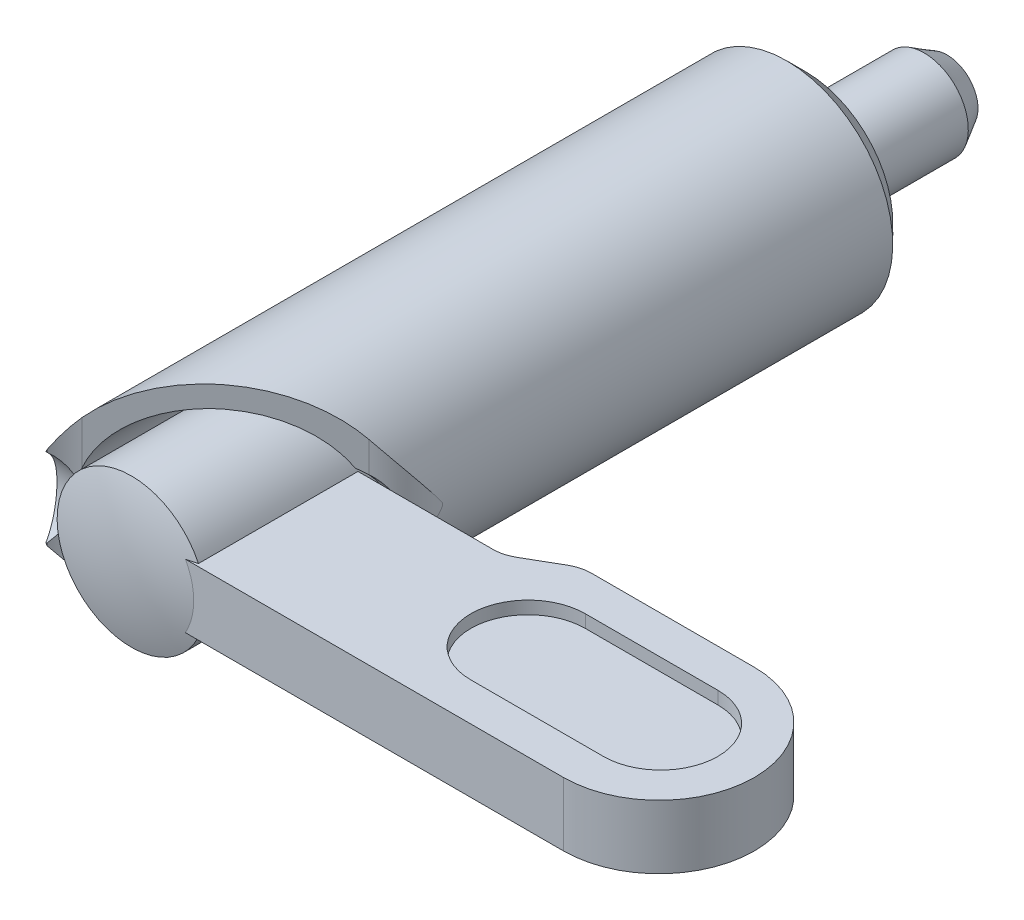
ISO-10303-21;
HEADER;
FILE_DESCRIPTION(('STEP AP214'),'2;1');
FILE_NAME('part.step','',(''),(''),'','','');
FILE_SCHEMA(('AUTOMOTIVE_DESIGN { 1 0 10303 214 1 1 1 1 }'));
ENDSEC;
DATA;
#1=APPLICATION_CONTEXT('core data for automotive mechanical design processes');
#2=APPLICATION_PROTOCOL_DEFINITION('international standard','automotive_design',2000,#1);
#3=PRODUCT_CONTEXT('',#1,'mechanical');
#4=PRODUCT('Part','Part','',(#3));
#5=PRODUCT_RELATED_PRODUCT_CATEGORY('part','',(#4));
#6=PRODUCT_DEFINITION_FORMATION('','',#4);
#7=PRODUCT_DEFINITION_CONTEXT('part definition',#1,'design');
#8=PRODUCT_DEFINITION('design','',#6,#7);
#9=PRODUCT_DEFINITION_SHAPE('','',#8);
#10=(LENGTH_UNIT() NAMED_UNIT(*) SI_UNIT(.MILLI.,.METRE.));
#11=(NAMED_UNIT(*) PLANE_ANGLE_UNIT() SI_UNIT($,.RADIAN.));
#12=(NAMED_UNIT(*) SI_UNIT($,.STERADIAN.) SOLID_ANGLE_UNIT());
#13=UNCERTAINTY_MEASURE_WITH_UNIT(LENGTH_MEASURE(1.E-05),#10,'distance_accuracy_value','');
#14=(GEOMETRIC_REPRESENTATION_CONTEXT(3) GLOBAL_UNCERTAINTY_ASSIGNED_CONTEXT((#13)) GLOBAL_UNIT_ASSIGNED_CONTEXT((#10,
#11,#12)) REPRESENTATION_CONTEXT('',''));
#15=CARTESIAN_POINT('',(0.,0.,0.));
#16=DIRECTION('',(0.,0.,1.));
#17=DIRECTION('',(1.,0.,0.));
#18=AXIS2_PLACEMENT_3D('',#15,#16,#17);
#19=CARTESIAN_POINT('',(-4.5911236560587,24.,36.34284085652));
#20=DIRECTION('',(-0.608367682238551,0.,-0.79365531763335));
#21=DIRECTION('',(0.79365531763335,0.,-0.608367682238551));
#22=AXIS2_PLACEMENT_3D('',#19,#20,#21);
#23=PLANE('',#22);
#24=CARTESIAN_POINT('',(2.07333496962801,0.,31.2342740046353));
#25=DIRECTION('',(-0.608367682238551,0.,-0.79365531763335));
#26=DIRECTION('',(-0.79365531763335,0.,0.608367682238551));
#27=AXIS2_PLACEMENT_3D('',#24,#25,#26);
#28=ELLIPSE('',#27,4.73397927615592,2.88000000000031);
#29=CARTESIAN_POINT('',(4.15973278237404,-2.39512487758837,29.6349688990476));
#30=VERTEX_POINT('',#29);
#31=CARTESIAN_POINT('',(4.5911236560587,-2.13765423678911,29.304291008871));
#32=VERTEX_POINT('',#31);
#33=EDGE_CURVE('E330',#30,#32,#28,.F.);
#34=ORIENTED_EDGE('',*,*,#33,.F.);
#35=CARTESIAN_POINT('',(0.,0.,32.8235659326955));
#36=DIRECTION('',(-0.608367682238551,0.,-0.79365531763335));
#37=DIRECTION('',(0.79365531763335,0.,-0.608367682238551));
#38=AXIS2_PLACEMENT_3D('',#35,#36,#37);
#39=ELLIPSE('',#38,6.04796552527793,4.8);
#40=CARTESIAN_POINT('',(-4.5911236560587,-1.40056544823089,36.34284085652));
#41=VERTEX_POINT('',#40);
#42=EDGE_CURVE('E472',#30,#41,#39,.T.);
#43=ORIENTED_EDGE('',*,*,#42,.T.);
#44=DIRECTION('',(0.,-1.,0.));
#45=VECTOR('',#44,1.);
#46=CARTESIAN_POINT('',(-4.5911236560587,24.,36.34284085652));
#47=LINE('',#46,#45);
#48=CARTESIAN_POINT('',(-4.5911236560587,-3.86284656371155,36.34284085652));
#49=VERTEX_POINT('',#48);
#50=EDGE_CURVE('E474',#41,#49,#47,.T.);
#51=ORIENTED_EDGE('',*,*,#50,.T.);
#52=CARTESIAN_POINT('',(0.,0.,32.8235659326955));
#53=DIRECTION('',(-0.608367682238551,0.,-0.79365531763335));
#54=DIRECTION('',(0.79365531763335,0.,-0.608367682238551));
#55=AXIS2_PLACEMENT_3D('',#52,#53,#54);
#56=ELLIPSE('',#55,7.55995690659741,6.);
#57=CARTESIAN_POINT('',(4.5911236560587,-3.86284656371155,29.304291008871));
#58=VERTEX_POINT('',#57);
#59=EDGE_CURVE('E441',#49,#58,#56,.F.);
#60=ORIENTED_EDGE('',*,*,#59,.T.);
#61=DIRECTION('',(0.,-1.,0.));
#62=VECTOR('',#61,1.);
#63=CARTESIAN_POINT('',(4.5911236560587,24.,29.304291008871));
#64=LINE('',#63,#62);
#65=EDGE_CURVE('E473',#32,#58,#64,.T.);
#66=ORIENTED_EDGE('',*,*,#65,.F.);
#67=EDGE_LOOP('',(#34,#43,#51,#60,#66));
#68=FACE_BOUND('',#67,.T.);
#69=ADVANCED_FACE('F14',(#68),#23,.F.);
#70=CARTESIAN_POINT('',(2.40100000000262,24.,26.4471318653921));
#71=DIRECTION('',(0.,-1.,0.));
#72=DIRECTION('',(1.,0.,0.));
#73=AXIS2_PLACEMENT_3D('',#70,#71,#72);
#74=CYLINDRICAL_SURFACE('',#73,3.59999999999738);
#75=CARTESIAN_POINT('',(4.5911236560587,-2.13765423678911,29.304291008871));
#76=CARTESIAN_POINT('',(4.63745048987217,-2.10561681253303,29.2687958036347));
#77=CARTESIAN_POINT('',(4.68201375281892,-2.07153338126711,29.2328324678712));
#78=CARTESIAN_POINT('',(4.76743931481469,-1.99924944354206,29.1606293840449));
#79=CARTESIAN_POINT('',(4.80830094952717,-1.96104820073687,29.1243895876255));
#80=CARTESIAN_POINT('',(4.88606220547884,-1.88058799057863,29.052371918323));
#81=CARTESIAN_POINT('',(4.92296887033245,-1.8383364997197,29.0165933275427));
#82=CARTESIAN_POINT('',(4.99280621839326,-1.74986126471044,28.9461321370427));
#83=CARTESIAN_POINT('',(5.0257374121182,-1.70363803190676,28.9114493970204));
#84=CARTESIAN_POINT('',(5.11867160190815,-1.55904934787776,28.8099011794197));
#85=CARTESIAN_POINT('',(5.17271007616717,-1.45487423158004,28.7456364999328));
#86=CARTESIAN_POINT('',(5.2654289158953,-1.23397116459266,28.629021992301));
#87=CARTESIAN_POINT('',(5.30411600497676,-1.11724873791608,28.5766669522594));
#88=CARTESIAN_POINT('',(5.36706004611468,-0.876826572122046,28.4880611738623));
#89=CARTESIAN_POINT('',(5.39157168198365,-0.753296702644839,28.4515293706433));
#90=CARTESIAN_POINT('',(5.42858419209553,-0.500693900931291,28.3951766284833));
#91=CARTESIAN_POINT('',(5.44107780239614,-0.37161766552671,28.3753657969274));
#92=CARTESIAN_POINT('',(5.45509745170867,-0.106881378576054,28.3530899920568));
#93=CARTESIAN_POINT('',(5.45623021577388,0.0288521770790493,28.3512470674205));
#94=CARTESIAN_POINT('',(5.44658896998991,0.298810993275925,28.3666282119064));
#95=CARTESIAN_POINT('',(5.43581464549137,0.433036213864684,28.3838527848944));
#96=CARTESIAN_POINT('',(5.40135021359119,0.698002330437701,28.436832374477));
#97=CARTESIAN_POINT('',(5.37748822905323,0.828672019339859,28.4728336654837));
#98=CARTESIAN_POINT('',(5.31526956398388,1.08060295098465,28.5613542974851));
#99=CARTESIAN_POINT('',(5.27691929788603,1.20186832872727,28.6138663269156));
#100=CARTESIAN_POINT('',(5.18534962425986,1.42834249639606,28.7302693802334));
#101=CARTESIAN_POINT('',(5.13253582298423,1.53388275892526,28.7938348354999));
#102=CARTESIAN_POINT('',(5.01077146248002,1.72973848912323,28.928517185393));
#103=CARTESIAN_POINT('',(4.94182836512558,1.82006096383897,28.9996305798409));
#104=CARTESIAN_POINT('',(4.82376514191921,1.94612121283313,29.1104820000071));
#105=CARTESIAN_POINT('',(4.78019017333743,1.98780630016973,29.1495462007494));
#106=CARTESIAN_POINT('',(4.6887986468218,2.06632160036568,29.2273460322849));
#107=CARTESIAN_POINT('',(4.64099024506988,2.10316082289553,29.2660821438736));
#108=CARTESIAN_POINT('',(4.5911236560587,2.13765423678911,29.304291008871));
#109=B_SPLINE_CURVE_WITH_KNOTS('',3,(#75,#76,#77,#78,#79,#80,#81,#82,#83,#84,#85,#86,#87,#88,
#89,#90,#91,#92,#93,#94,#95,#96,#97,#98,#99,#100,#101,#102,#103,#104,#105,#106,#107,#108),
.UNSPECIFIED.,.F.,.F.,(4,2,2,2,2,2,2,2,2,2,2,2,2,2,2,2,4),(0.,0.199685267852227,
0.399406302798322,0.598765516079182,0.798099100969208,1.19730526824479,1.59633639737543,
1.98795576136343,2.37981167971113,2.78518739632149,3.19057382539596,3.60141620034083,
4.01207689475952,4.41222899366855,4.8121963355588,5.0274892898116,5.24237612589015),.UNSPECIFIED.);
#110=CARTESIAN_POINT('',(4.5911236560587,2.13765423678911,29.304291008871));
#111=VERTEX_POINT('',#110);
#112=EDGE_CURVE('E322',#32,#111,#109,.T.);
#113=ORIENTED_EDGE('',*,*,#112,.F.);
#114=ORIENTED_EDGE('',*,*,#65,.T.);
#115=CARTESIAN_POINT('',(0.,6.,29.129518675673));
#116=CARTESIAN_POINT('',(-0.149832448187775,5.99999874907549,28.9953924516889));
#117=CARTESIAN_POINT('',(-0.288439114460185,5.99437295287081,28.8486408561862));
#118=CARTESIAN_POINT('',(-0.539144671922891,5.97705575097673,28.5342514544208));
#119=CARTESIAN_POINT('',(-0.651220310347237,5.96535905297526,28.3665955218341));
#120=CARTESIAN_POINT('',(-0.845744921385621,5.9409037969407,28.0152228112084));
#121=CARTESIAN_POINT('',(-0.92822854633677,5.92814650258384,27.8315251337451));
#122=CARTESIAN_POINT('',(-1.06148614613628,5.9057469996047,27.4528456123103));
#123=CARTESIAN_POINT('',(-1.11227176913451,5.89610364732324,27.257867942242));
#124=CARTESIAN_POINT('',(-1.18087874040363,5.88275288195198,26.8606673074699));
#125=CARTESIAN_POINT('',(-1.19848460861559,5.87908429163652,26.6584056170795));
#126=CARTESIAN_POINT('',(-1.19949304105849,5.87887910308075,26.2537981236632));
#127=CARTESIAN_POINT('',(-1.18289653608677,5.88234231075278,26.051452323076));
#128=CARTESIAN_POINT('',(-1.11665208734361,5.89526686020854,25.6562111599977));
#129=CARTESIAN_POINT('',(-1.0676026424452,5.90461944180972,25.4632113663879));
#130=CARTESIAN_POINT('',(-0.938510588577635,5.92650517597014,25.0880640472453));
#131=CARTESIAN_POINT('',(-0.858460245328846,5.93903912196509,24.9059192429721));
#132=CARTESIAN_POINT('',(-0.6677661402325,5.96350824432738,24.554169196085));
#133=CARTESIAN_POINT('',(-0.556625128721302,5.97542960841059,24.3848299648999));
#134=CARTESIAN_POINT('',(-0.369835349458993,5.98891620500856,24.1465426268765));
#135=CARTESIAN_POINT('',(-0.304183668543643,5.99268002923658,24.0696954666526));
#136=CARTESIAN_POINT('',(-0.166621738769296,5.99808067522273,23.9217605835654));
#137=CARTESIAN_POINT('',(-0.0947142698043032,5.99971843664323,23.8506703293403));
#138=CARTESIAN_POINT('',(0.0541657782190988,6.00021307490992,23.7153925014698));
#139=CARTESIAN_POINT('',(0.131087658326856,5.99909453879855,23.6511491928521));
#140=CARTESIAN_POINT('',(0.289912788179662,5.99351813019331,23.529372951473));
#141=CARTESIAN_POINT('',(0.371813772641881,5.98906176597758,23.4718370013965));
#142=CARTESIAN_POINT('',(0.539871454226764,5.97625603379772,23.363924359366));
#143=CARTESIAN_POINT('',(0.626026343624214,5.96790830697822,23.313544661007));
#144=CARTESIAN_POINT('',(0.801797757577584,5.94684382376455,23.2202995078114));
#145=CARTESIAN_POINT('',(0.891414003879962,5.93412741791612,23.1774334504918));
#146=CARTESIAN_POINT('',(1.06636624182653,5.90509317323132,23.102416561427));
#147=CARTESIAN_POINT('',(1.15151820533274,5.88911754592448,23.0697027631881));
#148=CARTESIAN_POINT('',(1.32327085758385,5.8529188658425,23.0110384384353));
#149=CARTESIAN_POINT('',(1.40987201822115,5.83269440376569,22.9850901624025));
#150=CARTESIAN_POINT('',(1.58367432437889,5.78792005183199,22.9399917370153));
#151=CARTESIAN_POINT('',(1.67087513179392,5.7633724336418,22.9208380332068));
#152=CARTESIAN_POINT('',(1.84517572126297,5.70996127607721,22.8891942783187));
#153=CARTESIAN_POINT('',(1.93227545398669,5.68109614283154,22.8767066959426));
#154=CARTESIAN_POINT('',(2.18731820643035,5.58994387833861,22.8495032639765));
#155=CARTESIAN_POINT('',(2.35420963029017,5.52176616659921,22.8437481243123));
#156=CARTESIAN_POINT('',(2.68050208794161,5.37096893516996,22.8542773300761));
#157=CARTESIAN_POINT('',(2.83989961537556,5.28834273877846,22.8705718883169));
#158=CARTESIAN_POINT('',(3.09987658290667,5.13864828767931,22.9139901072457));
#159=CARTESIAN_POINT('',(3.203225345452,5.07482700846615,22.9361152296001));
#160=CARTESIAN_POINT('',(3.4045032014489,4.94205491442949,22.9882600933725));
#161=CARTESIAN_POINT('',(3.50243067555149,4.87310258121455,23.0182821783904));
#162=CARTESIAN_POINT('',(3.78773583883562,4.65934396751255,23.118821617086));
#163=CARTESIAN_POINT('',(3.96647443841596,4.50773047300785,23.1997823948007));
#164=CARTESIAN_POINT('',(4.24760325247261,4.2406366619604,23.3540415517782));
#165=CARTESIAN_POINT('',(4.35645642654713,4.12857246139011,23.421900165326));
#166=CARTESIAN_POINT('',(4.5628044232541,3.89930309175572,23.5657432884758));
#167=CARTESIAN_POINT('',(4.66029971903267,3.78209813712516,23.6417274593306));
#168=CARTESIAN_POINT('',(4.84433427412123,3.54333241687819,23.8004510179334));
#169=CARTESIAN_POINT('',(4.93085216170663,3.42176372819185,23.8832030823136));
#170=CARTESIAN_POINT('',(5.09306925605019,3.1752810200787,24.054092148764));
#171=CARTESIAN_POINT('',(5.16876847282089,3.05036700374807,24.1422291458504));
#172=CARTESIAN_POINT('',(5.3366456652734,2.74957527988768,24.3573801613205));
#173=CARTESIAN_POINT('',(5.42407153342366,2.57245810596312,24.4863834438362));
#174=CARTESIAN_POINT('',(5.57983611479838,2.21440062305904,24.7505121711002));
#175=CARTESIAN_POINT('',(5.64816670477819,2.0334587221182,24.8856401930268));
#176=CARTESIAN_POINT('',(5.76633378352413,1.6691320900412,25.1599681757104));
#177=CARTESIAN_POINT('',(5.81619852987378,1.48575153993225,25.2991615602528));
#178=CARTESIAN_POINT('',(5.89810195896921,1.11716298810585,25.5801327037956));
#179=CARTESIAN_POINT('',(5.9301467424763,0.931955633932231,25.7219095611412));
#180=CARTESIAN_POINT('',(5.96809941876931,0.629009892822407,25.9532455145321));
#181=CARTESIAN_POINT('',(5.97929612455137,0.51181430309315,26.0426012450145));
#182=CARTESIAN_POINT('',(5.99143073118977,0.327430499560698,26.180185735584));
#183=CARTESIAN_POINT('',(5.99471452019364,0.260889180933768,26.2292385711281));
#184=CARTESIAN_POINT('',(5.99801450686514,0.158149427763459,26.2988860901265));
#185=CARTESIAN_POINT('',(5.99884343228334,0.123563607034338,26.3213618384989));
#186=CARTESIAN_POINT('',(5.99951208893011,0.077068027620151,26.3435208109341));
#187=CARTESIAN_POINT('',(5.99962851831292,0.0674813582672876,26.3477021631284));
#188=CARTESIAN_POINT('',(5.99981716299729,0.0478587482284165,26.3547916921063));
#189=CARTESIAN_POINT('',(5.99988955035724,0.037824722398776,26.3577048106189));
#190=CARTESIAN_POINT('',(5.99997491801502,0.0192411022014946,26.3612106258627));
#191=CARTESIAN_POINT('',(5.99999637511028,0.0107578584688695,26.3621315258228));
#192=CARTESIAN_POINT('',(6.00000276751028,-0.00622162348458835,26.3624019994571));
#193=CARTESIAN_POINT('',(5.9999877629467,-0.0147178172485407,26.3617541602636));
#194=CARTESIAN_POINT('',(5.9999111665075,-0.0346381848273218,26.3585817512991));
#195=CARTESIAN_POINT('',(5.99983413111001,-0.0459573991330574,26.3554412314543));
#196=CARTESIAN_POINT('',(5.9996241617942,-0.068063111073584,26.3475265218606));
#197=CARTESIAN_POINT('',(5.99949073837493,-0.0788439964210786,26.342738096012));
#198=CARTESIAN_POINT('',(5.99863119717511,-0.136706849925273,26.3146807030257));
#199=CARTESIAN_POINT('',(5.99745196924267,-0.180288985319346,26.2848083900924));
#200=CARTESIAN_POINT('',(5.99422904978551,-0.26646140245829,26.2241146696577));
#201=CARTESIAN_POINT('',(5.99218298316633,-0.309048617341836,26.1932908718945));
#202=CARTESIAN_POINT('',(5.98477662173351,-0.435427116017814,26.1003101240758));
#203=CARTESIAN_POINT('',(5.97813608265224,-0.518537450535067,26.0371600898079));
#204=CARTESIAN_POINT('',(5.96141631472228,-0.684412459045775,25.9108764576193));
#205=CARTESIAN_POINT('',(5.95133464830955,-0.767176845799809,25.8477429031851));
#206=CARTESIAN_POINT('',(5.92772444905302,-0.932221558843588,25.7216681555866));
#207=CARTESIAN_POINT('',(5.91420031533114,-1.01450236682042,25.6587268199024));
#208=CARTESIAN_POINT('',(5.88367334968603,-1.17870920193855,25.5332585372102));
#209=CARTESIAN_POINT('',(5.86667081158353,-1.2606352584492,25.4707315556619));
#210=CARTESIAN_POINT('',(5.80993608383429,-1.50780030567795,25.2824560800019));
#211=CARTESIAN_POINT('',(5.76475584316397,-1.67245541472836,25.1575258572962));
#212=CARTESIAN_POINT('',(5.65958701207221,-1.99965437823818,24.9110388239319));
#213=CARTESIAN_POINT('',(5.59959235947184,-2.16219733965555,24.7894834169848));
#214=CARTESIAN_POINT('',(5.46423214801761,-2.48449904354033,24.550971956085));
#215=CARTESIAN_POINT('',(5.38885494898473,-2.64425557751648,24.4340194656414));
#216=CARTESIAN_POINT('',(5.2221981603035,-2.95981008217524,24.2064339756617));
#217=CARTESIAN_POINT('',(5.1309252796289,-3.11560969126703,24.095798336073));
#218=CARTESIAN_POINT('',(4.88918979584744,-3.48767674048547,23.8370972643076));
#219=CARTESIAN_POINT('',(4.73009050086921,-3.70137409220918,23.693208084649));
#220=CARTESIAN_POINT('',(4.37637008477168,-4.11350760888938,23.4294337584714));
#221=CARTESIAN_POINT('',(4.18180689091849,-4.3119679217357,23.3095101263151));
#222=CARTESIAN_POINT('',(3.8042285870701,-4.64500508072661,23.1268289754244));
#223=CARTESIAN_POINT('',(3.62843167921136,-4.78391974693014,23.0572816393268));
#224=CARTESIAN_POINT('',(3.3497078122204,-4.97919285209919,22.9730307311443));
#225=CARTESIAN_POINT('',(3.25430901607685,-5.04209312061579,22.9482940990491));
#226=CARTESIAN_POINT('',(3.0588471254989,-5.1630065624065,22.9063384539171));
#227=CARTESIAN_POINT('',(2.95878489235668,-5.22102063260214,22.889118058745));
#228=CARTESIAN_POINT('',(2.77263765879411,-5.32180685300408,22.8653626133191));
#229=CARTESIAN_POINT('',(2.68720092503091,-5.36546240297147,22.8574784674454));
#230=CARTESIAN_POINT('',(2.51405132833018,-5.44874006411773,22.8478633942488));
#231=CARTESIAN_POINT('',(2.42633892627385,-5.48836298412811,22.8461312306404));
#232=CARTESIAN_POINT('',(2.24920986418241,-5.56329949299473,22.8492429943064));
#233=CARTESIAN_POINT('',(2.15979339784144,-5.59861356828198,22.8540861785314));
#234=CARTESIAN_POINT('',(1.97997253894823,-5.66470468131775,22.8706973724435));
#235=CARTESIAN_POINT('',(1.88956862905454,-5.69548383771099,22.8824621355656));
#236=CARTESIAN_POINT('',(1.70806811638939,-5.7525295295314,22.9132447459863));
#237=CARTESIAN_POINT('',(1.61697028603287,-5.77877331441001,22.9322977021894));
#238=CARTESIAN_POINT('',(1.43541422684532,-5.82652499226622,22.9777806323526));
#239=CARTESIAN_POINT('',(1.34495576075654,-5.84803474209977,23.0042077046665));
#240=CARTESIAN_POINT('',(1.16550873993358,-5.88642596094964,23.0644523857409));
#241=CARTESIAN_POINT('',(1.07652048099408,-5.90330650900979,23.0982714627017));
#242=CARTESIAN_POINT('',(0.900907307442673,-5.93264631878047,23.1731687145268));
#243=CARTESIAN_POINT('',(0.814282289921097,-5.94510577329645,23.214246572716));
#244=CARTESIAN_POINT('',(0.650366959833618,-5.96517721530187,23.30019439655));
#245=CARTESIAN_POINT('',(0.572854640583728,-5.97307462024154,23.3445752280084));
#246=CARTESIAN_POINT('',(0.421151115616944,-5.98568587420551,23.4391091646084));
#247=CARTESIAN_POINT('',(0.346961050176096,-5.99039863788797,23.4892642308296));
#248=CARTESIAN_POINT('',(0.130246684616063,-6.0003246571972,23.6479080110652));
#249=CARTESIAN_POINT('',(-0.00655897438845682,-6.00134094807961,23.7646472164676));
#250=CARTESIAN_POINT('',(-0.266493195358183,-5.99555354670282,24.0223757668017));
#251=CARTESIAN_POINT('',(-0.388795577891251,-5.98841635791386,24.1641836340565));
#252=CARTESIAN_POINT('',(-0.609895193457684,-5.96995379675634,24.4648735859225));
#253=CARTESIAN_POINT('',(-0.708683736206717,-5.95862687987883,24.6237619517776));
#254=CARTESIAN_POINT('',(-0.88667509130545,-5.93485349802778,24.9668706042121));
#255=CARTESIAN_POINT('',(-0.96395345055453,-5.92238517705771,25.1520912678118));
#256=CARTESIAN_POINT('',(-1.08674405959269,-5.90109314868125,25.5329787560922));
#257=CARTESIAN_POINT('',(-1.1322576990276,-5.89226928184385,25.7286451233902));
#258=CARTESIAN_POINT('',(-1.19038085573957,-5.88080808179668,26.1266153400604));
#259=CARTESIAN_POINT('',(-1.20272407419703,-5.87822083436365,26.3289597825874));
#260=CARTESIAN_POINT('',(-1.19332722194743,-5.88013526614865,26.7328077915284));
#261=CARTESIAN_POINT('',(-1.17158865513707,-5.88463663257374,26.9343113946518));
#262=CARTESIAN_POINT('',(-1.09537171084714,-5.89928853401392,27.3273623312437));
#263=CARTESIAN_POINT('',(-1.04143432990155,-5.90934552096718,27.5190185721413));
#264=CARTESIAN_POINT('',(-0.902851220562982,-5.9320966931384,27.8907235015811));
#265=CARTESIAN_POINT('',(-0.818197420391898,-5.94479157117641,28.0707691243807));
#266=CARTESIAN_POINT('',(-0.618435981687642,-5.96890163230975,28.4178602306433));
#267=CARTESIAN_POINT('',(-0.502791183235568,-5.98028862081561,28.5846016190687));
#268=CARTESIAN_POINT('',(-0.30958499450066,-5.99235538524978,28.8184195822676));
#269=CARTESIAN_POINT('',(-0.241851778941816,-5.9955423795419,28.8936789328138));
#270=CARTESIAN_POINT('',(-0.100264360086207,-5.99957981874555,29.0382498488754));
#271=CARTESIAN_POINT('',(-0.0264129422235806,-6.00043132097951,29.1075640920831));
#272=CARTESIAN_POINT('',(0.125730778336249,-5.99915772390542,29.2387435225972));
#273=CARTESIAN_POINT('',(0.20394236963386,-5.99707596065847,29.3007027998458));
#274=CARTESIAN_POINT('',(0.365095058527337,-5.98942463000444,29.4178229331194));
#275=CARTESIAN_POINT('',(0.44803398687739,-5.98385665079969,29.472986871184));
#276=CARTESIAN_POINT('',(0.617893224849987,-5.96870789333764,29.57609287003));
#277=CARTESIAN_POINT('',(0.704811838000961,-5.95912881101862,29.62403797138));
#278=CARTESIAN_POINT('',(0.881819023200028,-5.93551714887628,29.7123838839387));
#279=CARTESIAN_POINT('',(0.97190734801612,-5.92148491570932,29.7527852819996));
#280=CARTESIAN_POINT('',(1.14734009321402,-5.8899011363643,29.823012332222));
#281=CARTESIAN_POINT('',(1.23251910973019,-5.87270162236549,29.8534111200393));
#282=CARTESIAN_POINT('',(1.40406808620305,-5.83406599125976,29.9075102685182));
#283=CARTESIAN_POINT('',(1.49043843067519,-5.81262847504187,29.9312084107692));
#284=CARTESIAN_POINT('',(1.66354190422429,-5.76547189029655,29.9719090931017));
#285=CARTESIAN_POINT('',(1.75027484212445,-5.73975485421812,29.9889147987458));
#286=CARTESIAN_POINT('',(1.9234247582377,-5.68407686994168,30.0163923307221));
#287=CARTESIAN_POINT('',(2.00984160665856,-5.65411434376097,30.0268617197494));
#288=CARTESIAN_POINT('',(2.26411449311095,-5.55931138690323,30.0484845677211));
#289=CARTESIAN_POINT('',(2.43062987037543,-5.48856961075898,30.0506736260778));
#290=CARTESIAN_POINT('',(2.75557372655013,-5.33285785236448,30.0333319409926));
#291=CARTESIAN_POINT('',(2.91399832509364,-5.24788112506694,30.0137908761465));
#292=CARTESIAN_POINT('',(3.17365852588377,-5.09345888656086,29.9649136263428));
#293=CARTESIAN_POINT('',(3.27768675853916,-5.02710054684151,29.9403342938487));
#294=CARTESIAN_POINT('',(3.48000175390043,-4.88923173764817,29.8832354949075));
#295=CARTESIAN_POINT('',(3.57828670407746,-4.81771965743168,29.8507135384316));
#296=CARTESIAN_POINT('',(3.86424231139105,-4.59627248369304,29.7426554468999));
#297=CARTESIAN_POINT('',(4.04283656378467,-4.43953326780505,29.6566635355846));
#298=CARTESIAN_POINT('',(4.32336710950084,-4.16347151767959,29.4937905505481));
#299=CARTESIAN_POINT('',(4.43196312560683,-4.04750907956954,29.4222723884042));
#300=CARTESIAN_POINT('',(4.63737065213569,-3.81042861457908,29.2711173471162));
#301=CARTESIAN_POINT('',(4.73417778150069,-3.68930869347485,29.1914774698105));
#302=CARTESIAN_POINT('',(4.91638341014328,-3.44277857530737,29.0255162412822));
#303=CARTESIAN_POINT('',(5.00176212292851,-3.31736139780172,28.9391837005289));
#304=CARTESIAN_POINT('',(5.16130324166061,-3.06324220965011,28.7612196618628));
#305=CARTESIAN_POINT('',(5.23546589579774,-2.93454027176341,28.6695882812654));
#306=CARTESIAN_POINT('',(5.39869978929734,-2.62581530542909,28.4469667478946));
#307=CARTESIAN_POINT('',(5.48296490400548,-2.44460976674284,28.314079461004));
#308=CARTESIAN_POINT('',(5.63194617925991,-2.07852538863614,28.042431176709));
#309=CARTESIAN_POINT('',(5.69665236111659,-1.89364472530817,27.9036672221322));
#310=CARTESIAN_POINT('',(5.80709812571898,-1.52157487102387,27.6224286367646));
#311=CARTESIAN_POINT('',(5.85286585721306,-1.33438953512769,27.4799598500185));
#312=CARTESIAN_POINT('',(5.9260594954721,-0.958407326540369,27.1926494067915));
#313=CARTESIAN_POINT('',(5.95349883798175,-0.76961173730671,27.0478095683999));
#314=CARTESIAN_POINT('',(5.98118235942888,-0.484365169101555,26.8313649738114));
#315=CARTESIAN_POINT('',(5.98816456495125,-0.388810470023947,26.7592559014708));
#316=CARTESIAN_POINT('',(5.99531872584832,-0.242256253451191,26.6523463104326));
#317=CARTESIAN_POINT('',(5.99715131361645,-0.192252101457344,26.616499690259));
#318=CARTESIAN_POINT('',(5.99868328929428,-0.126376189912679,26.5765436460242));
#319=CARTESIAN_POINT('',(5.99895427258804,-0.11286353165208,26.5687041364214));
#320=CARTESIAN_POINT('',(5.9994120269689,-0.0851418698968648,26.5542779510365));
#321=CARTESIAN_POINT('',(5.99959886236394,-0.070933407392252,26.5476903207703));
#322=CARTESIAN_POINT('',(5.99981804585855,-0.0475204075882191,26.5394292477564));
#323=CARTESIAN_POINT('',(5.99988232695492,-0.0386539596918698,26.5368484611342));
#324=CARTESIAN_POINT('',(5.99997111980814,-0.020652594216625,26.5332156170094));
#325=CARTESIAN_POINT('',(5.9999959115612,-0.0115200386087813,26.5321528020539));
#326=CARTESIAN_POINT('',(6.00000317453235,0.00683625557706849,26.5318435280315));
#327=CARTESIAN_POINT('',(5.99998538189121,0.0160602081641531,26.5326083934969));
#328=CARTESIAN_POINT('',(5.99990908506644,0.0342665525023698,26.5357680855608));
#329=CARTESIAN_POINT('',(5.99985029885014,0.0432468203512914,26.5381742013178));
#330=CARTESIAN_POINT('',(5.99951121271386,0.082487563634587,26.5510746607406));
#331=CARTESIAN_POINT('',(5.99904173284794,0.110754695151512,26.5669055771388));
#332=CARTESIAN_POINT('',(5.99776635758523,0.166003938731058,26.6007398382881));
#333=CARTESIAN_POINT('',(5.99695566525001,0.192961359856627,26.6187714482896));
#334=CARTESIAN_POINT('',(5.99406846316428,0.271788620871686,26.6732505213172));
#335=CARTESIAN_POINT('',(5.9915217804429,0.322929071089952,26.710879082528));
#336=CARTESIAN_POINT('',(5.98516274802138,0.424752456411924,26.7866275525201));
#337=CARTESIAN_POINT('',(5.98134884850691,0.475434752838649,26.8247480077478));
#338=CARTESIAN_POINT('',(5.9724902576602,0.576102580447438,26.9008987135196));
#339=CARTESIAN_POINT('',(5.96745642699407,0.626090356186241,26.9389269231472));
#340=CARTESIAN_POINT('',(5.95614038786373,0.725885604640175,27.0149871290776));
#341=CARTESIAN_POINT('',(5.94985856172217,0.775693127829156,27.0530191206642));
#342=CARTESIAN_POINT('',(5.91505646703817,1.02627655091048,27.2444429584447));
#343=CARTESIAN_POINT('',(5.87693607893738,1.2261651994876,27.397411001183));
#344=CARTESIAN_POINT('',(5.77974607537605,1.62370517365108,27.699880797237));
#345=CARTESIAN_POINT('',(5.72065862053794,1.82135444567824,27.8493794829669));
#346=CARTESIAN_POINT('',(5.58056101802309,2.21379550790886,28.1432942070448));
#347=CARTESIAN_POINT('',(5.49948026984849,2.40857592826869,28.2876921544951));
#348=CARTESIAN_POINT('',(5.31458057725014,2.79297076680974,28.5682788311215));
#349=CARTESIAN_POINT('',(5.21078039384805,2.98258930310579,28.7044742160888));
#350=CARTESIAN_POINT('',(4.95922281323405,3.38706255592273,28.9882739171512));
#351=CARTESIAN_POINT('',(4.80697263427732,3.6006337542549,29.1337985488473));
#352=CARTESIAN_POINT('',(4.46796155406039,4.01353700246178,29.4025268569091));
#353=CARTESIAN_POINT('',(4.2812766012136,4.21289907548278,29.5257784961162));
#354=CARTESIAN_POINT('',(3.91145736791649,4.55534058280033,29.7202510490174));
#355=CARTESIAN_POINT('',(3.7344957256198,4.70188518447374,29.7969163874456));
#356=CARTESIAN_POINT('',(3.45268047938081,4.90842118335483,29.891517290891));
#357=CARTESIAN_POINT('',(3.35602022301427,4.9750490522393,29.9196502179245));
#358=CARTESIAN_POINT('',(3.15755877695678,5.10330838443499,29.9682175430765));
#359=CARTESIAN_POINT('',(3.0557586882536,5.16494091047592,29.9886535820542));
#360=CARTESIAN_POINT('',(2.86777297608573,5.27116485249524,30.0177533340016));
#361=CARTESIAN_POINT('',(2.78237787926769,5.3167459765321,30.0279298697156));
#362=CARTESIAN_POINT('',(2.60907509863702,5.40389928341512,30.0421644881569));
#363=CARTESIAN_POINT('',(2.52116795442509,5.44547231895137,30.046223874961));
#364=CARTESIAN_POINT('',(2.34338860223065,5.5243084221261,30.0477680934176));
#365=CARTESIAN_POINT('',(2.25351662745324,5.56157199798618,30.0452537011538));
#366=CARTESIAN_POINT('',(2.07250812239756,5.6315289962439,30.0332599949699));
#367=CARTESIAN_POINT('',(1.98137221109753,5.66422457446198,30.0237839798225));
#368=CARTESIAN_POINT('',(1.7980530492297,5.72506622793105,29.9974946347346));
#369=CARTESIAN_POINT('',(1.70586679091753,5.75318566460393,29.9806403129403));
#370=CARTESIAN_POINT('',(1.52186401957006,5.80457163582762,29.9394099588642));
#371=CARTESIAN_POINT('',(1.43004737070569,5.82784015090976,29.9150370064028));
#372=CARTESIAN_POINT('',(1.24766028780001,5.86959040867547,29.8587166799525));
#373=CARTESIAN_POINT('',(1.15708973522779,5.88807260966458,29.8267700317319));
#374=CARTESIAN_POINT('',(0.978127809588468,5.92043474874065,29.7554135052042));
#375=CARTESIAN_POINT('',(0.889736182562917,5.93431522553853,29.7160045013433));
#376=CARTESIAN_POINT('',(0.65840937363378,5.96554040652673,29.601381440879));
#377=CARTESIAN_POINT('',(0.518081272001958,5.97910068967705,29.5197293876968));
#378=CARTESIAN_POINT('',(0.24939235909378,5.99633183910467,29.3379726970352));
#379=CARTESIAN_POINT('',(0.121033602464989,6.00000101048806,29.2378649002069));
#380=CARTESIAN_POINT('',(0.,6.,29.129518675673));
#381=B_SPLINE_CURVE_WITH_KNOTS('',3,(#115,#116,#117,#118,#119,#120,#121,#122,#123,#124,#125,
#126,#127,#128,#129,#130,#131,#132,#133,#134,#135,#136,#137,#138,#139,#140,#141,#142,#143,#144,
#145,#146,#147,#148,#149,#150,#151,#152,#153,#154,#155,#156,#157,#158,#159,#160,#161,#162,#163,
#164,#165,#166,#167,#168,#169,#170,#171,#172,#173,#174,#175,#176,#177,#178,#179,#180,#181,#182,
#183,#184,#185,#186,#187,#188,#189,#190,#191,#192,#193,#194,#195,#196,#197,#198,#199,#200,#201,
#202,#203,#204,#205,#206,#207,#208,#209,#210,#211,#212,#213,#214,#215,#216,#217,#218,#219,#220,
#221,#222,#223,#224,#225,#226,#227,#228,#229,#230,#231,#232,#233,#234,#235,#236,#237,#238,#239,
#240,#241,#242,#243,#244,#245,#246,#247,#248,#249,#250,#251,#252,#253,#254,#255,#256,#257,#258,
#259,#260,#261,#262,#263,#264,#265,#266,#267,#268,#269,#270,#271,#272,#273,#274,#275,#276,#277,
#278,#279,#280,#281,#282,#283,#284,#285,#286,#287,#288,#289,#290,#291,#292,#293,#294,#295,#296,
#297,#298,#299,#300,#301,#302,#303,#304,#305,#306,#307,#308,#309,#310,#311,#312,#313,#314,#315,
#316,#317,#318,#319,#320,#321,#322,#323,#324,#325,#326,#327,#328,#329,#330,#331,#332,#333,#334,
#335,#336,#337,#338,#339,#340,#341,#342,#343,#344,#345,#346,#347,#348,#349,#350,#351,#352,#353,
#354,#355,#356,#357,#358,#359,#360,#361,#362,#363,#364,#365,#366,#367,#368,#369,#370,#371,#372,
#373,#374,#375,#376,#377,#378,#379,#380),.UNSPECIFIED.,.T.,.F.,(4,2,2,2,2,2,2,2,2,2,2,2,2,2,2,2,
2,2,2,2,2,2,2,2,2,2,2,2,2,2,2,2,2,2,2,2,2,2,2,2,2,2,2,2,2,2,2,2,2,2,2,2,2,2,2,2,2,2,2,2,2,2,2,2,
2,2,2,2,2,2,2,2,2,2,2,2,2,2,2,2,2,2,2,2,2,2,2,2,2,2,2,2,2,2,2,2,2,2,2,2,2,2,2,2,2,2,2,2,2,2,2,2,
2,2,2,2,2,2,2,2,2,2,2,2,2,2,2,2,2,2,2,2,4),(0.,0.602685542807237,1.2058973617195,
1.80840049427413,2.4106820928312,3.01686180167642,3.6230250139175,4.21830979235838,
4.81374318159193,5.4193052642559,5.72242314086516,6.02540700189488,6.32569795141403,
6.62585328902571,6.92588215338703,7.22588694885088,7.50336011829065,7.78092546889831,
8.05834540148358,8.33586800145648,8.87453926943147,9.41346012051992,9.78337426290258,
10.1533983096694,10.8940083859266,11.4044246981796,11.9148197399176,12.4261936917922,
12.9375671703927,13.644293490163,14.35131999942,15.0572600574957,15.7629582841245,
16.2060212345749,16.4544616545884,16.5776687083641,16.60899794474,16.6402039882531,
16.6656713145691,16.6910966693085,16.7261165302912,16.7614468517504,16.9190543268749,
17.0770964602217,17.3906165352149,17.7043591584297,18.0177028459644,18.3310200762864,
18.9651393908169,19.599518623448,20.2343796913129,20.8689734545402,21.7743906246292,
22.6783419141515,23.379299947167,23.7296842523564,24.0800040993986,24.368523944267,
24.6569858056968,24.9454150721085,25.233709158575,25.5234098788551,25.8129967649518,
26.1026412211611,26.3922730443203,26.6609573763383,26.9297332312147,27.4668235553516,
28.0266934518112,28.5867699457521,29.1872077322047,29.7876192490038,30.3928367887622,
30.9980276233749,31.5933255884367,32.1887801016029,32.7953101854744,33.0988986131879,
33.402349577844,33.7013640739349,34.0002424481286,34.29899458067,34.5977234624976,
34.8735635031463,35.1494947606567,35.4252953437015,35.7011987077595,36.2415785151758,
36.7822151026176,37.1591666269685,37.5362364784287,38.2909984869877,38.813095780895,
39.3353865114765,39.858570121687,40.3817421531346,41.1006883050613,41.8200006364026,
42.5382399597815,43.2559521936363,43.6157805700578,43.8001419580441,43.8469982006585,
43.8938185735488,43.9214337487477,43.9488522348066,43.976441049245,44.0042215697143,
44.1003393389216,44.1978560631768,44.3882618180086,44.5789013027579,44.7679022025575,
44.9568452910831,45.7195898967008,46.482985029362,47.248860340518,48.0141055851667,
48.9112493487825,49.8064375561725,50.530112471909,50.8919019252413,51.2536142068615,
51.5453305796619,51.8369847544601,52.128604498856,52.4200861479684,52.7132081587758,
53.0062102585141,53.2991842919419,53.5921240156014,54.0788857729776,54.5657309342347),.UNSPECIFIED.);
#382=CARTESIAN_POINT('',(4.5911236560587,3.86284656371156,29.304291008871));
#383=VERTEX_POINT('',#382);
#384=EDGE_CURVE('E437',#58,#383,#381,.T.);
#385=ORIENTED_EDGE('',*,*,#384,.T.);
#386=EDGE_CURVE('E476',#383,#111,#64,.T.);
#387=ORIENTED_EDGE('',*,*,#386,.T.);
#388=EDGE_LOOP('',(#113,#114,#385,#387));
#389=FACE_BOUND('',#388,.T.);
#390=ADVANCED_FACE('F332',(#389),#74,.T.);
#391=CARTESIAN_POINT('',(2.07333496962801,0.,31.2342740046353));
#392=DIRECTION('',(-0.608367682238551,0.,-0.79365531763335));
#393=DIRECTION('',(-0.79365531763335,0.,0.608367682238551));
#394=AXIS2_PLACEMENT_3D('',#391,#392,#393);
#395=ELLIPSE('',#394,4.73397927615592,2.88000000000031);
#396=CARTESIAN_POINT('',(4.15973278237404,2.39512487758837,29.6349688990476));
#397=VERTEX_POINT('',#396);
#398=EDGE_CURVE('E320',#111,#397,#395,.F.);
#399=ORIENTED_EDGE('',*,*,#398,.F.);
#400=ORIENTED_EDGE('',*,*,#386,.F.);
#401=CARTESIAN_POINT('',(-4.5911236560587,3.86284656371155,36.34284085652));
#402=VERTEX_POINT('',#401);
#403=EDGE_CURVE('E442',#383,#402,#56,.F.);
#404=ORIENTED_EDGE('',*,*,#403,.T.);
#405=CARTESIAN_POINT('',(-4.5911236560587,1.40056544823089,36.34284085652));
#406=VERTEX_POINT('',#405);
#407=EDGE_CURVE('E464',#402,#406,#47,.T.);
#408=ORIENTED_EDGE('',*,*,#407,.T.);
#409=EDGE_CURVE('E469',#406,#397,#39,.T.);
#410=ORIENTED_EDGE('',*,*,#409,.T.);
#411=EDGE_LOOP('',(#399,#400,#404,#408,#410));
#412=FACE_BOUND('',#411,.T.);
#413=ADVANCED_FACE('F368',(#412),#23,.F.);
#414=CARTESIAN_POINT('',(0.,0.,25.));
#415=DIRECTION('',(0.,0.,-1.));
#416=DIRECTION('',(0.,1.,0.));
#417=AXIS2_PLACEMENT_3D('',#414,#415,#416);
#418=CYLINDRICAL_SURFACE('',#417,4.8);
#419=CARTESIAN_POINT('',(0.,0.,25.));
#420=DIRECTION('',(0.,0.,-1.));
#421=DIRECTION('',(0.,1.,0.));
#422=AXIS2_PLACEMENT_3D('',#419,#420,#421);
#423=CIRCLE('',#422,4.8);
#424=CARTESIAN_POINT('',(0.,4.8,25.));
#425=VERTEX_POINT('',#424);
#426=EDGE_CURVE('E425',#425,#425,#423,.T.);
#427=ORIENTED_EDGE('',*,*,#426,.T.);
#428=EDGE_LOOP('',(#427));
#429=FACE_BOUND('',#428,.T.);
#430=CARTESIAN_POINT('',(4.08529068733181,2.52,29.84));
#431=CARTESIAN_POINT('',(4.11055424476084,2.47904692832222,29.766002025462));
#432=CARTESIAN_POINT('',(4.136853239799,2.43503125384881,29.6941226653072));
#433=CARTESIAN_POINT('',(4.19070754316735,2.34113158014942,29.554818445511));
#434=CARTESIAN_POINT('',(4.21826266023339,2.29124847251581,29.4873929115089));
#435=CARTESIAN_POINT('',(4.30180175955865,2.1327858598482,29.2916240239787));
#436=CARTESIAN_POINT('',(4.35846706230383,2.01568964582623,29.1703211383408));
#437=CARTESIAN_POINT('',(4.46750804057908,1.76083831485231,28.9490388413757));
#438=CARTESIAN_POINT('',(4.51988099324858,1.62307023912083,28.8490729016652));
#439=CARTESIAN_POINT('',(4.59097729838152,1.40317148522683,28.7177675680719));
#440=CARTESIAN_POINT('',(4.6134279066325,1.32768301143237,28.6771135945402));
#441=CARTESIAN_POINT('',(4.65523470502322,1.17269564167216,28.6024358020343));
#442=CARTESIAN_POINT('',(4.67459265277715,1.09319905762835,28.5684082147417));
#443=CARTESIAN_POINT('',(4.70855602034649,0.935728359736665,28.5093066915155));
#444=CARTESIAN_POINT('',(4.72337988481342,0.857959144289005,28.4838120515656));
#445=CARTESIAN_POINT('',(4.74935819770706,0.699998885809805,28.4394346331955));
#446=CARTESIAN_POINT('',(4.76051471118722,0.619809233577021,28.4205481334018));
#447=CARTESIAN_POINT('',(4.77882527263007,0.457684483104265,28.3896779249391));
#448=CARTESIAN_POINT('',(4.78598086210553,0.375750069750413,28.3776915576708));
#449=CARTESIAN_POINT('',(4.79607583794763,0.210926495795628,28.3608118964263));
#450=CARTESIAN_POINT('',(4.79901578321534,0.128037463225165,28.3559176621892));
#451=CARTESIAN_POINT('',(4.80112667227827,-0.098639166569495,28.3523905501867));
#452=CARTESIAN_POINT('',(4.79597364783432,-0.24266711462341,28.3609464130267));
#453=CARTESIAN_POINT('',(4.77314442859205,-0.526734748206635,28.3992199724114));
#454=CARTESIAN_POINT('',(4.75546983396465,-0.666774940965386,28.4289349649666));
#455=CARTESIAN_POINT('',(4.70967462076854,-0.936673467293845,28.5072934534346));
#456=CARTESIAN_POINT('',(4.68175607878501,-1.06667347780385,28.5555715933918));
#457=CARTESIAN_POINT('',(4.61766137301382,-1.31677677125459,28.6692406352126));
#458=CARTESIAN_POINT('',(4.58148051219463,-1.4368743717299,28.7346412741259));
#459=CARTESIAN_POINT('',(4.49926277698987,-1.67765133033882,28.8885434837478));
#460=CARTESIAN_POINT('',(4.45258421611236,-1.79700193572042,28.9787738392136));
#461=CARTESIAN_POINT('',(4.3561127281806,-2.01965342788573,29.175757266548));
#462=CARTESIAN_POINT('',(4.30632071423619,-2.12295898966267,29.2825055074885));
#463=CARTESIAN_POINT('',(4.22736562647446,-2.27453774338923,29.4654136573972));
#464=CARTESIAN_POINT('',(4.19786218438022,-2.32837454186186,29.5368879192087));
#465=CARTESIAN_POINT('',(4.1402798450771,-2.4292916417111,29.6847827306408));
#466=CARTESIAN_POINT('',(4.11219849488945,-2.47638385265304,29.7611942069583));
#467=CARTESIAN_POINT('',(4.08529068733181,-2.52,29.84));
#468=B_SPLINE_CURVE_WITH_KNOTS('',3,(#430,#431,#432,#433,#434,#435,#436,#437,#438,#439,#440,
#441,#442,#443,#444,#445,#446,#447,#448,#449,#450,#451,#452,#453,#454,#455,#456,#457,#458,#459,
#460,#461,#462,#463,#464,#465,#466,#467),.UNSPECIFIED.,.F.,.F.,(4,2,2,2,2,2,2,2,2,2,2,2,2,2,2,2,
2,2,4),(0.,0.26461221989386,0.529184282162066,1.06022251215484,1.59159504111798,
1.85715917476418,2.1225718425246,2.37173078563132,2.62074918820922,2.86967158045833,
3.11856096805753,3.54932172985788,3.98002745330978,4.40265744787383,4.82552830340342,
5.29391493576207,5.76216483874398,6.04447863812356,6.32628761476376),.UNSPECIFIED.);
#469=EDGE_CURVE('E349',#397,#30,#468,.T.);
#470=ORIENTED_EDGE('',*,*,#469,.F.);
#471=ORIENTED_EDGE('',*,*,#409,.F.);
#472=CARTESIAN_POINT('',(-4.5911236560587,-1.40056544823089,36.34284085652));
#473=CARTESIAN_POINT('',(-4.62184601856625,-1.2998800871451,36.3664069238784));
#474=CARTESIAN_POINT('',(-4.64936817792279,-1.19776830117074,36.3882770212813));
#475=CARTESIAN_POINT('',(-4.69777563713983,-0.991044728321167,36.4276682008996));
#476=CARTESIAN_POINT('',(-4.71865354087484,-0.886430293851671,36.4451844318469));
#477=CARTESIAN_POINT('',(-4.75341994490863,-0.675563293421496,36.4748143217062));
#478=CARTESIAN_POINT('',(-4.76732706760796,-0.56931588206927,36.4869423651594));
#479=CARTESIAN_POINT('',(-4.78800816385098,-0.355653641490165,36.5051186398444));
#480=CARTESIAN_POINT('',(-4.79478545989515,-0.248239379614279,36.5111697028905));
#481=CARTESIAN_POINT('',(-4.8011116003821,-0.0324027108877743,36.5168147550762));
#482=CARTESIAN_POINT('',(-4.80061848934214,0.076021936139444,36.5163712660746));
#483=CARTESIAN_POINT('',(-4.79230972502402,0.292391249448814,36.5089653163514));
#484=CARTESIAN_POINT('',(-4.78449209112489,0.400335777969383,36.5020010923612));
#485=CARTESIAN_POINT('',(-4.76169499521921,0.614707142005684,36.4820327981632));
#486=CARTESIAN_POINT('',(-4.74672710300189,0.72113614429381,36.4690384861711));
#487=CARTESIAN_POINT('',(-4.70986513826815,0.932001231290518,36.4378047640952));
#488=CARTESIAN_POINT('',(-4.68797111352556,1.03643732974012,36.4195653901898));
#489=CARTESIAN_POINT('',(-4.65200275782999,1.18360624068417,36.3905202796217));
#490=CARTESIAN_POINT('',(-4.64064594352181,1.22737286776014,36.3814511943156));
#491=CARTESIAN_POINT('',(-4.61676080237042,1.31436282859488,36.3626359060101));
#492=CARTESIAN_POINT('',(-4.60423431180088,1.35758689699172,36.352890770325));
#493=CARTESIAN_POINT('',(-4.5911236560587,1.40056544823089,36.34284085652));
#494=B_SPLINE_CURVE_WITH_KNOTS('',3,(#472,#473,#474,#475,#476,#477,#478,#479,#480,#481,#482,
#483,#484,#485,#486,#487,#488,#489,#490,#491,#492,#493),.UNSPECIFIED.,.F.,.F.,(4,2,2,2,2,2,2,2,
2,2,4),(0.,0.323627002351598,0.647613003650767,0.970728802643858,1.2936939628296,
1.61852359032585,1.94344108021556,2.26783459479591,2.59222587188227,2.73055779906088,
2.86867609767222),.UNSPECIFIED.);
#495=CARTESIAN_POINT('',(-4.7368926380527,0.775788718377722,36.4607290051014));
#496=VERTEX_POINT('',#495);
#497=EDGE_CURVE('E381',#496,#406,#494,.T.);
#498=ORIENTED_EDGE('',*,*,#497,.F.);
#499=CARTESIAN_POINT('',(-4.65988819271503,1.15127843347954,36.5943956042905));
#500=CARTESIAN_POINT('',(-4.67574532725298,1.087130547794,36.5664129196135));
#501=CARTESIAN_POINT('',(-4.69049275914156,1.02171527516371,36.5406751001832));
#502=CARTESIAN_POINT('',(-4.71750088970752,0.888691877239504,36.4939107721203));
#503=CARTESIAN_POINT('',(-4.72976048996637,0.821082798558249,36.4728863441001));
#504=CARTESIAN_POINT('',(-4.75149571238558,0.684168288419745,36.4358218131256));
#505=CARTESIAN_POINT('',(-4.76097526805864,0.614865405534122,36.4197746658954));
#506=CARTESIAN_POINT('',(-4.7769635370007,0.474961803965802,36.3928139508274));
#507=CARTESIAN_POINT('',(-4.78347277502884,0.404361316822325,36.3818994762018));
#508=CARTESIAN_POINT('',(-4.79832138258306,0.190829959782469,36.357036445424));
#509=CARTESIAN_POINT('',(-4.80192536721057,0.0465163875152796,36.3510628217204));
#510=CARTESIAN_POINT('',(-4.7961046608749,-0.240988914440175,36.3607690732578));
#511=CARTESIAN_POINT('',(-4.78668525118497,-0.38418107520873,36.3764401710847));
#512=CARTESIAN_POINT('',(-4.75928730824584,-0.63337434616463,36.4226084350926));
#513=CARTESIAN_POINT('',(-4.74373680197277,-0.740439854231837,36.4489330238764));
#514=CARTESIAN_POINT('',(-4.71566106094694,-0.897425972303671,36.4971171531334));
#515=CARTESIAN_POINT('',(-4.70551076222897,-0.94915287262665,36.5146281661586));
#516=CARTESIAN_POINT('',(-4.68375701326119,-1.05125974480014,36.5524432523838));
#517=CARTESIAN_POINT('',(-4.67215365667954,-1.10163980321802,36.5727471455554));
#518=CARTESIAN_POINT('',(-4.65988819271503,-1.15127843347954,36.5943956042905));
#519=B_SPLINE_CURVE_WITH_KNOTS('',3,(#499,#500,#501,#502,#503,#504,#505,#506,#507,#508,#509,
#510,#511,#512,#513,#514,#515,#516,#517,#518),.UNSPECIFIED.,.F.,.F.,(4,2,2,2,2,2,2,2,2,4),(0.,
0.215241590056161,0.430578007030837,0.645608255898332,0.860600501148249,1.29166327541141,
1.72255129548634,2.05563669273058,2.22218084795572,2.38871427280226),.UNSPECIFIED.);
#520=CARTESIAN_POINT('',(-4.73689263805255,-0.775788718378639,36.4607290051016));
#521=VERTEX_POINT('',#520);
#522=EDGE_CURVE('E357',#496,#521,#519,.T.);
#523=ORIENTED_EDGE('',*,*,#522,.T.);
#524=EDGE_CURVE('E373',#41,#521,#494,.T.);
#525=ORIENTED_EDGE('',*,*,#524,.F.);
#526=ORIENTED_EDGE('',*,*,#42,.F.);
#527=EDGE_LOOP('',(#470,#471,#498,#523,#525,#526));
#528=FACE_BOUND('',#527,.T.);
#529=ADVANCED_FACE('F364',(#429,#528),#418,.F.);
#530=CARTESIAN_POINT('',(0.,0.,37.4));
#531=DIRECTION('',(0.,0.,1.));
#532=DIRECTION('',(0.,-1.,0.));
#533=AXIS2_PLACEMENT_3D('',#530,#531,#532);
#534=PLANE('',#533);
#535=DIRECTION('',(1.,0.,0.));
#536=VECTOR('',#535,1.);
#537=CARTESIAN_POINT('',(-6.5,-2.22032404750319,37.4));
#538=LINE('',#537,#536);
#539=CARTESIAN_POINT('',(-5.57406145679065,-2.22032404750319,37.4));
#540=VERTEX_POINT('',#539);
#541=CARTESIAN_POINT('',(-5.51869145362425,-2.22032404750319,37.4));
#542=VERTEX_POINT('',#541);
#543=EDGE_CURVE('E417',#540,#542,#538,.T.);
#544=ORIENTED_EDGE('',*,*,#543,.F.);
#545=CARTESIAN_POINT('',(0.,0.,37.4));
#546=DIRECTION('',(0.,0.,-1.));
#547=DIRECTION('',(0.,1.,0.));
#548=AXIS2_PLACEMENT_3D('',#545,#546,#547);
#549=CIRCLE('',#548,6.);
#550=CARTESIAN_POINT('',(-5.51869145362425,-2.35457950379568,37.4));
#551=VERTEX_POINT('',#550);
#552=EDGE_CURVE('E450',#551,#540,#549,.T.);
#553=ORIENTED_EDGE('',*,*,#552,.F.);
#554=DIRECTION('',(0.,-1.,0.));
#555=VECTOR('',#554,1.);
#556=CARTESIAN_POINT('',(-5.51869145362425,24.,37.4));
#557=LINE('',#556,#555);
#558=EDGE_CURVE('E482',#542,#551,#557,.T.);
#559=ORIENTED_EDGE('',*,*,#558,.F.);
#560=EDGE_LOOP('',(#544,#553,#559));
#561=FACE_BOUND('',#560,.T.);
#562=ADVANCED_FACE('F367',(#561),#534,.T.);
#563=CARTESIAN_POINT('',(-2.40100000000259,24.,39.1999999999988));
#564=DIRECTION('',(0.,-1.,0.));
#565=DIRECTION('',(1.,0.,0.));
#566=AXIS2_PLACEMENT_3D('',#563,#564,#565);
#567=CYLINDRICAL_SURFACE('',#566,3.59999999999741);
#568=CARTESIAN_POINT('',(-5.51869145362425,2.35457950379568,37.4));
#569=VERTEX_POINT('',#568);
#570=CARTESIAN_POINT('',(-5.51869145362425,2.22032404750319,37.4));
#571=VERTEX_POINT('',#570);
#572=EDGE_CURVE('E479',#569,#571,#557,.T.);
#573=ORIENTED_EDGE('',*,*,#572,.T.);
#574=CARTESIAN_POINT('',(-5.51869145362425,2.22032404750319,37.4));
#575=CARTESIAN_POINT('',(-5.47947940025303,2.16417668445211,37.3320651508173));
#576=CARTESIAN_POINT('',(-5.43902441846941,2.10531618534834,37.2671391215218));
#577=CARTESIAN_POINT('',(-5.35662475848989,1.98244433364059,37.1433534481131));
#578=CARTESIAN_POINT('',(-5.31467977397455,1.91843191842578,37.0844950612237));
#579=CARTESIAN_POINT('',(-5.22987303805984,1.78486167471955,36.9723393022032));
#580=CARTESIAN_POINT('',(-5.18700628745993,1.71525294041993,36.9191063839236));
#581=CARTESIAN_POINT('',(-5.10198689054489,1.57121527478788,36.8190371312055));
#582=CARTESIAN_POINT('',(-5.05983406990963,1.49678754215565,36.7721992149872));
#583=CARTESIAN_POINT('',(-4.95764925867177,1.30583279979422,36.6639765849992));
#584=CARTESIAN_POINT('',(-4.8988393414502,1.18636624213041,36.6065246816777));
#585=CARTESIAN_POINT('',(-4.79190039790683,0.936840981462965,36.5076240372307));
#586=CARTESIAN_POINT('',(-4.7437294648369,0.806826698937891,36.4661120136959));
#587=CARTESIAN_POINT('',(-4.67628198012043,0.572600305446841,36.4099282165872));
#588=CARTESIAN_POINT('',(-4.65273257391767,0.470663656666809,36.3910609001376));
#589=CARTESIAN_POINT('',(-4.61911657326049,0.263239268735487,36.3644330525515));
#590=CARTESIAN_POINT('',(-4.60902424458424,0.157758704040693,36.3566513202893));
#591=CARTESIAN_POINT('',(-4.60409559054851,-0.0541646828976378,36.3528283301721));
#592=CARTESIAN_POINT('',(-4.60931267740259,-0.160609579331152,36.3568281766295));
#593=CARTESIAN_POINT('',(-4.63412633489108,-0.370779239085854,36.376283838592));
#594=CARTESIAN_POINT('',(-4.6537446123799,-0.474499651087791,36.391756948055));
#595=CARTESIAN_POINT('',(-4.71239928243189,-0.709522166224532,36.4396987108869));
#596=CARTESIAN_POINT('',(-4.75565534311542,-0.83894485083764,36.4760367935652));
#597=CARTESIAN_POINT('',(-4.85414505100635,-1.08798809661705,36.564387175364));
#598=CARTESIAN_POINT('',(-4.90944239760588,-1.20755167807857,36.6164834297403));
#599=CARTESIAN_POINT('',(-5.01200780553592,-1.40934652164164,36.7207508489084));
#600=CARTESIAN_POINT('',(-5.05809100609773,-1.49372907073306,36.7700028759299));
#601=CARTESIAN_POINT('',(-5.15163135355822,-1.65661458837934,36.8764154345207));
#602=CARTESIAN_POINT('',(-5.19908920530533,-1.73511446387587,36.933580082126));
#603=CARTESIAN_POINT('',(-5.2930068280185,-1.88500604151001,37.0547526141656));
#604=CARTESIAN_POINT('',(-5.33947117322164,-1.95648325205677,37.1186511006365));
#605=CARTESIAN_POINT('',(-5.43069290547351,-2.09317414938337,37.2538164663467));
#606=CARTESIAN_POINT('',(-5.47545137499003,-2.15839184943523,37.3250785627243));
#607=CARTESIAN_POINT('',(-5.51869145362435,-2.22032404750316,37.4));
#608=B_SPLINE_CURVE_WITH_KNOTS('',3,(#574,#575,#576,#577,#578,#579,#580,#581,#582,#583,#584,
#585,#586,#587,#588,#589,#590,#591,#592,#593,#594,#595,#596,#597,#598,#599,#600,#601,#602,#603,
#604,#605,#606,#607),.UNSPECIFIED.,.F.,.F.,(4,2,2,2,2,2,2,2,2,2,2,2,2,2,2,2,4),(0.,
0.289248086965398,0.578555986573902,0.870883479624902,1.16313853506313,1.59685830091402,
2.02883791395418,2.34651566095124,2.66358503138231,2.98176192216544,3.30041938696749,
3.72173796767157,4.14534198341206,4.46897706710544,4.79278113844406,5.11196053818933,
5.43093391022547),.UNSPECIFIED.);
#609=EDGE_CURVE('E414',#571,#496,#608,.T.);
#610=ORIENTED_EDGE('',*,*,#609,.T.);
#611=ORIENTED_EDGE('',*,*,#497,.T.);
#612=ORIENTED_EDGE('',*,*,#407,.F.);
#613=CARTESIAN_POINT('',(-4.5911236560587,3.86284656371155,36.34284085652));
#614=CARTESIAN_POINT('',(-4.69097325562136,3.74415121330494,36.4194171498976));
#615=CARTESIAN_POINT('',(-4.78497938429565,3.62310248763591,36.4997473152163));
#616=CARTESIAN_POINT('',(-4.96121095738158,3.37773846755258,36.6662311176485));
#617=CARTESIAN_POINT('',(-5.04349509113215,3.253443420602,36.7523523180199));
#618=CARTESIAN_POINT('',(-5.19720392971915,3.00180106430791,36.9295386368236));
#619=CARTESIAN_POINT('',(-5.26863075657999,2.87445435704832,37.0206027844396));
#620=CARTESIAN_POINT('',(-5.40134460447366,2.61659526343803,37.2072436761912));
#621=CARTESIAN_POINT('',(-5.46257673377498,2.48606981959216,37.3028414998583));
#622=CARTESIAN_POINT('',(-5.51869145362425,2.35457950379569,37.4));
#623=B_SPLINE_CURVE_WITH_KNOTS('',3,(#613,#614,#615,#616,#617,#618,#619,#620,#621,#622),
.UNSPECIFIED.,.F.,.F.,(4,2,2,2,4),(0.,0.518649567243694,1.03460351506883,1.55045649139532,
2.06900296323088),.UNSPECIFIED.);
#624=EDGE_CURVE('E399',#402,#569,#623,.T.);
#625=ORIENTED_EDGE('',*,*,#624,.T.);
#626=EDGE_LOOP('',(#573,#610,#611,#612,#625));
#627=FACE_BOUND('',#626,.T.);
#628=ADVANCED_FACE('F394',(#627),#567,.F.);
#629=DIRECTION('',(1.,0.,0.));
#630=VECTOR('',#629,1.);
#631=CARTESIAN_POINT('',(-6.5,2.22032404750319,37.4));
#632=LINE('',#631,#630);
#633=CARTESIAN_POINT('',(-5.57406145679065,2.22032404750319,37.4));
#634=VERTEX_POINT('',#633);
#635=EDGE_CURVE('E415',#571,#634,#632,.F.);
#636=ORIENTED_EDGE('',*,*,#635,.F.);
#637=ORIENTED_EDGE('',*,*,#572,.F.);
#638=EDGE_CURVE('E496',#634,#569,#549,.T.);
#639=ORIENTED_EDGE('',*,*,#638,.F.);
#640=EDGE_LOOP('',(#636,#637,#639));
#641=FACE_BOUND('',#640,.T.);
#642=ADVANCED_FACE('F16',(#641),#534,.T.);
#643=CARTESIAN_POINT('',(0.,0.,-8.));
#644=DIRECTION('',(0.,0.,-1.));
#645=DIRECTION('',(0.,1.,0.));
#646=AXIS2_PLACEMENT_3D('',#643,#644,#645);
#647=CYLINDRICAL_SURFACE('',#646,6.);
#648=CARTESIAN_POINT('',(-5.57406145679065,2.22032404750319,37.4));
#649=CARTESIAN_POINT('',(-5.59459639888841,2.1687711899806,37.3376084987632));
#650=CARTESIAN_POINT('',(-5.61532297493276,2.1146554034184,37.2774510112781));
#651=CARTESIAN_POINT('',(-5.65663896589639,2.00151684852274,37.1618630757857));
#652=CARTESIAN_POINT('',(-5.67722834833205,1.94249295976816,37.1064337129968));
#653=CARTESIAN_POINT('',(-5.7381096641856,1.75807839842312,36.9473690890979));
#654=CARTESIAN_POINT('',(-5.77739284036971,1.62563853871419,36.8513128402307));
#655=CARTESIAN_POINT('',(-5.84916703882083,1.34473273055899,36.6822078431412));
#656=CARTESIAN_POINT('',(-5.88164301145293,1.19623235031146,36.6092098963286));
#657=CARTESIAN_POINT('',(-5.93607186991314,0.887421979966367,36.4894233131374));
#658=CARTESIAN_POINT('',(-5.95804543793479,0.727135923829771,36.4425831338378));
#659=CARTESIAN_POINT('',(-5.98793047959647,0.410304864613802,36.379377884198));
#660=CARTESIAN_POINT('',(-5.99666270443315,0.254193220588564,36.3612308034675));
#661=CARTESIAN_POINT('',(-6.00175190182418,-0.0591369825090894,36.3506208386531));
#662=CARTESIAN_POINT('',(-5.99810872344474,-0.216355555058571,36.3581582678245));
#663=CARTESIAN_POINT('',(-5.97948591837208,-0.516666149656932,36.3972139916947));
#664=CARTESIAN_POINT('',(-5.96525275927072,-0.660015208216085,36.4271539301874));
#665=CARTESIAN_POINT('',(-5.92767485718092,-0.939444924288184,36.5079207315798));
#666=CARTESIAN_POINT('',(-5.90432778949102,-1.07552371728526,36.5587529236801));
#667=CARTESIAN_POINT('',(-5.84960984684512,-1.34211466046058,36.6817310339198));
#668=CARTESIAN_POINT('',(-5.81797783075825,-1.47224386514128,36.7545854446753));
#669=CARTESIAN_POINT('',(-5.74994743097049,-1.71885393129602,36.9187050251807));
#670=CARTESIAN_POINT('',(-5.71355146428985,-1.8353416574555,37.0099608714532));
#671=CARTESIAN_POINT('',(-5.65942207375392,-1.99341129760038,37.1545592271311));
#672=CARTESIAN_POINT('',(-5.64232116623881,-2.04123423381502,37.201479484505));
#673=CARTESIAN_POINT('',(-5.60812322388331,-2.13339162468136,37.2984290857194));
#674=CARTESIAN_POINT('',(-5.5910262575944,-2.17773325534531,37.3484516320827));
#675=CARTESIAN_POINT('',(-5.57406145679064,-2.22032404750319,37.4));
#676=B_SPLINE_CURVE_WITH_KNOTS('',3,(#648,#649,#650,#651,#652,#653,#654,#655,#656,#657,#658,
#659,#660,#661,#662,#663,#664,#665,#666,#667,#668,#669,#670,#671,#672,#673,#674,#675),
.UNSPECIFIED.,.F.,.F.,(4,2,2,2,2,2,2,2,2,2,2,2,2,4),(0.,0.250347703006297,0.500752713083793,
1.0029766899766,1.50629955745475,2.00862711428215,2.47832339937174,2.9480254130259,
3.38742726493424,3.82694126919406,4.28245417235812,4.73773685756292,4.94504030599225,
5.15190456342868),.UNSPECIFIED.);
#677=EDGE_CURVE('E419',#634,#540,#676,.T.);
#678=ORIENTED_EDGE('',*,*,#677,.F.);
#679=ORIENTED_EDGE('',*,*,#638,.T.);
#680=ORIENTED_EDGE('',*,*,#624,.F.);
#681=ORIENTED_EDGE('',*,*,#403,.F.);
#682=ORIENTED_EDGE('',*,*,#384,.F.);
#683=ORIENTED_EDGE('',*,*,#59,.F.);
#684=CARTESIAN_POINT('',(-5.51869145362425,-2.35457950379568,37.4));
#685=CARTESIAN_POINT('',(-5.46257673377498,-2.48606981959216,37.3028414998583));
#686=CARTESIAN_POINT('',(-5.40134460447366,-2.61659526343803,37.2072436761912));
#687=CARTESIAN_POINT('',(-5.26863075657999,-2.87445435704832,37.0206027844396));
#688=CARTESIAN_POINT('',(-5.19720392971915,-3.00180106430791,36.9295386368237));
#689=CARTESIAN_POINT('',(-5.04349509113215,-3.253443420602,36.7523523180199));
#690=CARTESIAN_POINT('',(-4.96121095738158,-3.37773846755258,36.6662311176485));
#691=CARTESIAN_POINT('',(-4.78497938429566,-3.62310248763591,36.4997473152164));
#692=CARTESIAN_POINT('',(-4.69097325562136,-3.74415121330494,36.4194171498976));
#693=CARTESIAN_POINT('',(-4.5911236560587,-3.86284656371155,36.34284085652));
#694=B_SPLINE_CURVE_WITH_KNOTS('',3,(#684,#685,#686,#687,#688,#689,#690,#691,#692,#693),
.UNSPECIFIED.,.F.,.F.,(4,2,2,2,4),(0.,0.518546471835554,1.03439944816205,1.55035339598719,
2.06900296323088),.UNSPECIFIED.);
#695=EDGE_CURVE('E382',#551,#49,#694,.T.);
#696=ORIENTED_EDGE('',*,*,#695,.F.);
#697=ORIENTED_EDGE('',*,*,#552,.T.);
#698=EDGE_LOOP('',(#678,#679,#680,#681,#682,#683,#696,#697));
#699=FACE_BOUND('',#698,.T.);
#700=CARTESIAN_POINT('',(0.,0.,1.0735));
#701=DIRECTION('',(0.,0.,-1.));
#702=DIRECTION('',(0.,1.,0.));
#703=AXIS2_PLACEMENT_3D('',#700,#701,#702);
#704=CIRCLE('',#703,6.);
#705=CARTESIAN_POINT('',(0.,6.,1.0735));
#706=VERTEX_POINT('',#705);
#707=EDGE_CURVE('E494',#706,#706,#704,.T.);
#708=ORIENTED_EDGE('',*,*,#707,.F.);
#709=EDGE_LOOP('',(#708));
#710=FACE_BOUND('',#709,.T.);
#711=ADVANCED_FACE('F427',(#699,#710),#647,.T.);
#712=CARTESIAN_POINT('',(0.,0.,0.));
#713=DIRECTION('',(0.,0.,1.));
#714=DIRECTION('',(0.,-1.,0.));
#715=AXIS2_PLACEMENT_3D('',#712,#713,#714);
#716=CONICAL_SURFACE('',#715,4.9265,0.785398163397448);
#717=ORIENTED_EDGE('',*,*,#707,.T.);
#718=EDGE_LOOP('',(#717));
#719=FACE_BOUND('',#718,.T.);
#720=CARTESIAN_POINT('',(0.,0.,0.));
#721=DIRECTION('',(0.,0.,-1.));
#722=DIRECTION('',(0.,1.,0.));
#723=AXIS2_PLACEMENT_3D('',#720,#721,#722);
#724=CIRCLE('',#723,4.9265);
#725=CARTESIAN_POINT('',(0.,4.9265,0.));
#726=VERTEX_POINT('',#725);
#727=EDGE_CURVE('E491',#726,#726,#724,.T.);
#728=ORIENTED_EDGE('',*,*,#727,.F.);
#729=EDGE_LOOP('',(#728));
#730=FACE_BOUND('',#729,.T.);
#731=ADVANCED_FACE('F431',(#719,#730),#716,.T.);
#732=CARTESIAN_POINT('',(4.9265,0.,0.));
#733=DIRECTION('',(0.,0.,-1.));
#734=DIRECTION('',(0.,1.,0.));
#735=AXIS2_PLACEMENT_3D('',#732,#733,#734);
#736=PLANE('',#735);
#737=ORIENTED_EDGE('',*,*,#727,.T.);
#738=EDGE_LOOP('',(#737));
#739=FACE_BOUND('',#738,.T.);
#740=CARTESIAN_POINT('',(0.,0.,0.));
#741=DIRECTION('',(0.,0.,-1.));
#742=DIRECTION('',(0.,1.,0.));
#743=AXIS2_PLACEMENT_3D('',#740,#741,#742);
#744=CIRCLE('',#743,2.5);
#745=CARTESIAN_POINT('',(0.,2.5,0.));
#746=VERTEX_POINT('',#745);
#747=EDGE_CURVE('E488',#746,#746,#744,.T.);
#748=ORIENTED_EDGE('',*,*,#747,.F.);
#749=EDGE_LOOP('',(#748));
#750=FACE_BOUND('',#749,.T.);
#751=ADVANCED_FACE('F595',(#739,#750),#736,.T.);
#752=CARTESIAN_POINT('',(0.,0.,-8.));
#753=DIRECTION('',(0.,0.,-1.));
#754=DIRECTION('',(0.,1.,0.));
#755=AXIS2_PLACEMENT_3D('',#752,#753,#754);
#756=CYLINDRICAL_SURFACE('',#755,2.5);
#757=ORIENTED_EDGE('',*,*,#747,.T.);
#758=EDGE_LOOP('',(#757));
#759=FACE_BOUND('',#758,.T.);
#760=CARTESIAN_POINT('',(0.,0.,-6.7));
#761=DIRECTION('',(0.,0.,-1.));
#762=DIRECTION('',(0.,1.,0.));
#763=AXIS2_PLACEMENT_3D('',#760,#761,#762);
#764=CIRCLE('',#763,2.5);
#765=CARTESIAN_POINT('',(0.,2.5,-6.7));
#766=VERTEX_POINT('',#765);
#767=EDGE_CURVE('E485',#766,#766,#764,.T.);
#768=ORIENTED_EDGE('',*,*,#767,.F.);
#769=EDGE_LOOP('',(#768));
#770=FACE_BOUND('',#769,.T.);
#771=ADVANCED_FACE('F602',(#759,#770),#756,.T.);
#772=CARTESIAN_POINT('',(0.,0.,-8.));
#773=DIRECTION('',(0.,0.,1.));
#774=DIRECTION('',(0.,-1.,0.));
#775=AXIS2_PLACEMENT_3D('',#772,#773,#774);
#776=CONICAL_SURFACE('',#775,1.7494446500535,0.523598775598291);
#777=ORIENTED_EDGE('',*,*,#767,.T.);
#778=EDGE_LOOP('',(#777));
#779=FACE_BOUND('',#778,.T.);
#780=CARTESIAN_POINT('',(0.,0.,-8.));
#781=DIRECTION('',(0.,0.,-1.));
#782=DIRECTION('',(0.,1.,0.));
#783=AXIS2_PLACEMENT_3D('',#780,#781,#782);
#784=CIRCLE('',#783,1.7494446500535);
#785=CARTESIAN_POINT('',(0.,1.7494446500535,-8.));
#786=VERTEX_POINT('',#785);
#787=EDGE_CURVE('E481',#786,#786,#784,.T.);
#788=ORIENTED_EDGE('',*,*,#787,.F.);
#789=EDGE_LOOP('',(#788));
#790=FACE_BOUND('',#789,.T.);
#791=ADVANCED_FACE('F610',(#779,#790),#776,.T.);
#792=CARTESIAN_POINT('',(1.7494446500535,0.,-8.));
#793=DIRECTION('',(0.,0.,-1.));
#794=DIRECTION('',(0.,1.,0.));
#795=AXIS2_PLACEMENT_3D('',#792,#793,#794);
#796=PLANE('',#795);
#797=ORIENTED_EDGE('',*,*,#787,.T.);
#798=EDGE_LOOP('',(#797));
#799=FACE_BOUND('',#798,.T.);
#800=ADVANCED_FACE('F392',(#799),#796,.T.);
#801=ORIENTED_EDGE('',*,*,#524,.T.);
#802=EDGE_CURVE('E407',#521,#542,#608,.T.);
#803=ORIENTED_EDGE('',*,*,#802,.T.);
#804=ORIENTED_EDGE('',*,*,#558,.T.);
#805=ORIENTED_EDGE('',*,*,#695,.T.);
#806=ORIENTED_EDGE('',*,*,#50,.F.);
#807=EDGE_LOOP('',(#801,#803,#804,#805,#806));
#808=FACE_BOUND('',#807,.T.);
#809=ADVANCED_FACE('F388',(#808),#567,.F.);
#810=CARTESIAN_POINT('',(4.8,0.,25.));
#811=DIRECTION('',(0.,0.,-1.));
#812=DIRECTION('',(0.,1.,0.));
#813=AXIS2_PLACEMENT_3D('',#810,#811,#812);
#814=PLANE('',#813);
#815=CARTESIAN_POINT('',(0.,0.,25.));
#816=DIRECTION('',(0.,0.,-1.));
#817=DIRECTION('',(0.,1.,0.));
#818=AXIS2_PLACEMENT_3D('',#815,#816,#817);
#819=CIRCLE('',#818,4.2);
#820=CARTESIAN_POINT('',(0.,4.2,25.));
#821=VERTEX_POINT('',#820);
#822=EDGE_CURVE('E314',#821,#821,#819,.T.);
#823=ORIENTED_EDGE('',*,*,#822,.T.);
#824=EDGE_LOOP('',(#823));
#825=FACE_BOUND('',#824,.T.);
#826=ORIENTED_EDGE('',*,*,#426,.F.);
#827=EDGE_LOOP('',(#826));
#828=FACE_BOUND('',#827,.T.);
#829=ADVANCED_FACE('F370',(#825,#828),#814,.F.);
#830=CARTESIAN_POINT('',(-6.5,0.,39.2342740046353));
#831=DIRECTION('',(1.,0.,0.));
#832=DIRECTION('',(0.,1.,0.));
#833=AXIS2_PLACEMENT_3D('',#830,#831,#832);
#834=CYLINDRICAL_SURFACE('',#833,2.88000000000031);
#835=ORIENTED_EDGE('',*,*,#677,.T.);
#836=ORIENTED_EDGE('',*,*,#543,.T.);
#837=ORIENTED_EDGE('',*,*,#802,.F.);
#838=ORIENTED_EDGE('',*,*,#522,.F.);
#839=ORIENTED_EDGE('',*,*,#609,.F.);
#840=ORIENTED_EDGE('',*,*,#635,.T.);
#841=EDGE_LOOP('',(#835,#836,#837,#838,#839,#840));
#842=FACE_BOUND('',#841,.T.);
#843=ADVANCED_FACE('F342',(#842),#834,.F.);
#844=CARTESIAN_POINT('',(6.5,0.,31.2342740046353));
#845=DIRECTION('',(-1.,0.,0.));
#846=DIRECTION('',(0.,-1.,0.));
#847=AXIS2_PLACEMENT_3D('',#844,#845,#846);
#848=CYLINDRICAL_SURFACE('',#847,2.88000000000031);
#849=ORIENTED_EDGE('',*,*,#33,.T.);
#850=ORIENTED_EDGE('',*,*,#112,.T.);
#851=ORIENTED_EDGE('',*,*,#398,.T.);
#852=ORIENTED_EDGE('',*,*,#469,.T.);
#853=EDGE_LOOP('',(#849,#850,#851,#852));
#854=FACE_BOUND('',#853,.T.);
#855=ADVANCED_FACE('F336',(#854),#848,.F.);
#856=CARTESIAN_POINT('',(-6.14222214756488E-12,0.,24.9999999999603));
#857=DIRECTION('',(0.,0.,-1.));
#858=DIRECTION('',(1.,0.,0.));
#859=AXIS2_PLACEMENT_3D('',#856,#857,#858);
#860=SPHERICAL_SURFACE('',#859,13.8000000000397);
#861=CARTESIAN_POINT('',(-6.14222214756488E-12,1.8,24.9999999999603));
#862=DIRECTION('',(0.,1.,0.));
#863=DIRECTION('',(-1.,0.,0.));
#864=AXIS2_PLACEMENT_3D('',#861,#862,#863);
#865=CIRCLE('',#864,13.6821051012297);
#866=CARTESIAN_POINT('',(3.79473319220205,1.8,38.145341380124));
#867=VERTEX_POINT('',#866);
#868=CARTESIAN_POINT('',(3.2109188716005,1.8,38.3));
#869=VERTEX_POINT('',#868);
#870=EDGE_CURVE('E312',#867,#869,#865,.F.);
#871=ORIENTED_EDGE('',*,*,#870,.F.);
#872=CARTESIAN_POINT('',(0.,0.,38.145341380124));
#873=DIRECTION('',(0.,0.,-1.));
#874=DIRECTION('',(0.,1.,0.));
#875=AXIS2_PLACEMENT_3D('',#872,#873,#874);
#876=CIRCLE('',#875,4.2);
#877=CARTESIAN_POINT('',(3.79473319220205,-1.8,38.145341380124));
#878=VERTEX_POINT('',#877);
#879=EDGE_CURVE('E317',#878,#867,#876,.T.);
#880=ORIENTED_EDGE('',*,*,#879,.F.);
#881=CARTESIAN_POINT('',(-6.14222214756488E-12,-1.8,24.9999999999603));
#882=DIRECTION('',(0.,1.,0.));
#883=DIRECTION('',(-1.,0.,0.));
#884=AXIS2_PLACEMENT_3D('',#881,#882,#883);
#885=CIRCLE('',#884,13.6821051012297);
#886=CARTESIAN_POINT('',(3.2109188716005,-1.8,38.3));
#887=VERTEX_POINT('',#886);
#888=EDGE_CURVE('E299',#878,#887,#885,.F.);
#889=ORIENTED_EDGE('',*,*,#888,.T.);
#890=CARTESIAN_POINT('',(-6.14222214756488E-12,0.,38.3));
#891=DIRECTION('',(0.,0.,1.));
#892=DIRECTION('',(0.,-1.,0.));
#893=AXIS2_PLACEMENT_3D('',#890,#891,#892);
#894=CIRCLE('',#893,3.68103246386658);
#895=EDGE_CURVE('E9',#869,#887,#894,.F.);
#896=ORIENTED_EDGE('',*,*,#895,.F.);
#897=EDGE_LOOP('',(#871,#880,#889,#896));
#898=FACE_BOUND('',#897,.T.);
#899=ADVANCED_FACE('F341',(#898),#860,.T.);
#900=CARTESIAN_POINT('',(0.,0.,1.));
#901=DIRECTION('',(0.,0.,-1.));
#902=DIRECTION('',(0.,1.,0.));
#903=AXIS2_PLACEMENT_3D('',#900,#901,#902);
#904=CYLINDRICAL_SURFACE('',#903,4.2);
#905=DIRECTION('',(0.,0.,-1.));
#906=VECTOR('',#905,1.);
#907=CARTESIAN_POINT('',(3.79473319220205,1.8,1.));
#908=LINE('',#907,#906);
#909=CARTESIAN_POINT('',(3.79473319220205,1.8,29.12));
#910=VERTEX_POINT('',#909);
#911=EDGE_CURVE('E22',#910,#867,#908,.F.);
#912=ORIENTED_EDGE('',*,*,#911,.F.);
#913=CARTESIAN_POINT('',(0.,0.,29.12));
#914=DIRECTION('',(0.,0.,-1.));
#915=DIRECTION('',(0.,1.,0.));
#916=AXIS2_PLACEMENT_3D('',#913,#914,#915);
#917=CIRCLE('',#916,4.2);
#918=CARTESIAN_POINT('',(3.79473319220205,-1.8,29.12));
#919=VERTEX_POINT('',#918);
#920=EDGE_CURVE('E857',#919,#910,#917,.F.);
#921=ORIENTED_EDGE('',*,*,#920,.F.);
#922=DIRECTION('',(0.,0.,-1.));
#923=VECTOR('',#922,1.);
#924=CARTESIAN_POINT('',(3.79473319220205,-1.8,1.));
#925=LINE('',#924,#923);
#926=EDGE_CURVE('E356',#919,#878,#925,.F.);
#927=ORIENTED_EDGE('',*,*,#926,.T.);
#928=ORIENTED_EDGE('',*,*,#879,.T.);
#929=EDGE_LOOP('',(#912,#921,#927,#928));
#930=FACE_BOUND('',#929,.T.);
#931=ORIENTED_EDGE('',*,*,#822,.F.);
#932=EDGE_LOOP('',(#931));
#933=FACE_BOUND('',#932,.T.);
#934=ADVANCED_FACE('F645',(#930,#933),#904,.T.);
#935=CARTESIAN_POINT('',(24.6,1.8,38.3));
#936=DIRECTION('',(0.,0.,1.));
#937=DIRECTION('',(0.,-1.,0.));
#938=AXIS2_PLACEMENT_3D('',#935,#936,#937);
#939=PLANE('',#938);
#940=DIRECTION('',(-1.,0.,0.));
#941=VECTOR('',#940,1.);
#942=CARTESIAN_POINT('',(24.6,1.8,38.3));
#943=LINE('',#942,#941);
#944=CARTESIAN_POINT('',(24.6,1.8,38.3));
#945=VERTEX_POINT('',#944);
#946=EDGE_CURVE('E276',#945,#869,#943,.T.);
#947=ORIENTED_EDGE('',*,*,#946,.T.);
#948=ORIENTED_EDGE('',*,*,#895,.T.);
#949=DIRECTION('',(-1.,0.,0.));
#950=VECTOR('',#949,1.);
#951=CARTESIAN_POINT('',(24.6,-1.8,38.3));
#952=LINE('',#951,#950);
#953=CARTESIAN_POINT('',(24.6,-1.8,38.3));
#954=VERTEX_POINT('',#953);
#955=EDGE_CURVE('E251',#954,#887,#952,.T.);
#956=ORIENTED_EDGE('',*,*,#955,.F.);
#957=DIRECTION('',(0.,-1.,0.));
#958=VECTOR('',#957,1.);
#959=CARTESIAN_POINT('',(24.6,1.8,38.3));
#960=LINE('',#959,#958);
#961=EDGE_CURVE('E297',#945,#954,#960,.T.);
#962=ORIENTED_EDGE('',*,*,#961,.F.);
#963=EDGE_LOOP('',(#947,#948,#956,#962));
#964=FACE_BOUND('',#963,.T.);
#965=ADVANCED_FACE('F654',(#964),#939,.T.);
#966=CARTESIAN_POINT('',(24.6,1.8,32.9));
#967=DIRECTION('',(0.,-1.,0.));
#968=DIRECTION('',(1.,0.,0.));
#969=AXIS2_PLACEMENT_3D('',#966,#967,#968);
#970=CYLINDRICAL_SURFACE('',#969,5.4);
#971=ORIENTED_EDGE('',*,*,#961,.T.);
#972=CARTESIAN_POINT('',(24.6,-1.8,32.9));
#973=DIRECTION('',(0.,-1.,0.));
#974=DIRECTION('',(1.,0.,0.));
#975=AXIS2_PLACEMENT_3D('',#972,#973,#974);
#976=CIRCLE('',#975,5.4);
#977=CARTESIAN_POINT('',(24.6,-1.8,27.5));
#978=VERTEX_POINT('',#977);
#979=EDGE_CURVE('E273',#978,#954,#976,.T.);
#980=ORIENTED_EDGE('',*,*,#979,.F.);
#981=DIRECTION('',(0.,-1.,0.));
#982=VECTOR('',#981,1.);
#983=CARTESIAN_POINT('',(24.6,1.8,27.5));
#984=LINE('',#983,#982);
#985=CARTESIAN_POINT('',(24.6,1.8,27.5));
#986=VERTEX_POINT('',#985);
#987=EDGE_CURVE('E300',#986,#978,#984,.T.);
#988=ORIENTED_EDGE('',*,*,#987,.F.);
#989=CARTESIAN_POINT('',(24.6,1.8,32.9));
#990=DIRECTION('',(0.,-1.,0.));
#991=DIRECTION('',(1.,0.,0.));
#992=AXIS2_PLACEMENT_3D('',#989,#990,#991);
#993=CIRCLE('',#992,5.4);
#994=EDGE_CURVE('E293',#986,#945,#993,.T.);
#995=ORIENTED_EDGE('',*,*,#994,.T.);
#996=EDGE_LOOP('',(#971,#980,#988,#995));
#997=FACE_BOUND('',#996,.T.);
#998=ADVANCED_FACE('F663',(#997),#970,.T.);
#999=CARTESIAN_POINT('',(15.384692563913,1.8,27.5));
#1000=DIRECTION('',(0.,0.,-1.));
#1001=DIRECTION('',(0.,1.,0.));
#1002=AXIS2_PLACEMENT_3D('',#999,#1000,#1001);
#1003=PLANE('',#1002);
#1004=ORIENTED_EDGE('',*,*,#987,.T.);
#1005=DIRECTION('',(1.,0.,0.));
#1006=VECTOR('',#1005,1.);
#1007=CARTESIAN_POINT('',(15.384692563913,-1.8,27.5));
#1008=LINE('',#1007,#1006);
#1009=CARTESIAN_POINT('',(15.384692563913,-1.8,27.5));
#1010=VERTEX_POINT('',#1009);
#1011=EDGE_CURVE('E270',#1010,#978,#1008,.T.);
#1012=ORIENTED_EDGE('',*,*,#1011,.F.);
#1013=DIRECTION('',(0.,-1.,0.));
#1014=VECTOR('',#1013,1.);
#1015=CARTESIAN_POINT('',(15.384692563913,1.8,27.5));
#1016=LINE('',#1015,#1014);
#1017=CARTESIAN_POINT('',(15.384692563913,1.8,27.5));
#1018=VERTEX_POINT('',#1017);
#1019=EDGE_CURVE('E302',#1018,#1010,#1016,.T.);
#1020=ORIENTED_EDGE('',*,*,#1019,.F.);
#1021=DIRECTION('',(1.,0.,0.));
#1022=VECTOR('',#1021,1.);
#1023=CARTESIAN_POINT('',(15.384692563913,1.8,27.5));
#1024=LINE('',#1023,#1022);
#1025=EDGE_CURVE('E290',#1018,#986,#1024,.T.);
#1026=ORIENTED_EDGE('',*,*,#1025,.T.);
#1027=EDGE_LOOP('',(#1004,#1012,#1020,#1026));
#1028=FACE_BOUND('',#1027,.T.);
#1029=ADVANCED_FACE('F673',(#1028),#1003,.T.);
#1030=CARTESIAN_POINT('',(15.3846925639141,1.8,29.6600000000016));
#1031=DIRECTION('',(0.,-1.,0.));
#1032=DIRECTION('',(1.,0.,0.));
#1033=AXIS2_PLACEMENT_3D('',#1030,#1031,#1032);
#1034=CYLINDRICAL_SURFACE('',#1033,2.16000000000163);
#1035=ORIENTED_EDGE('',*,*,#1019,.T.);
#1036=CARTESIAN_POINT('',(15.3846925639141,-1.8,29.6600000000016));
#1037=DIRECTION('',(0.,-1.,0.));
#1038=DIRECTION('',(1.,0.,0.));
#1039=AXIS2_PLACEMENT_3D('',#1036,#1037,#1038);
#1040=CIRCLE('',#1039,2.16000000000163);
#1041=CARTESIAN_POINT('',(14.304692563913,-1.8,27.789385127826));
#1042=VERTEX_POINT('',#1041);
#1043=EDGE_CURVE('E267',#1042,#1010,#1040,.T.);
#1044=ORIENTED_EDGE('',*,*,#1043,.F.);
#1045=DIRECTION('',(0.,-1.,0.));
#1046=VECTOR('',#1045,1.);
#1047=CARTESIAN_POINT('',(14.304692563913,1.8,27.789385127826));
#1048=LINE('',#1047,#1046);
#1049=CARTESIAN_POINT('',(14.304692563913,1.8,27.789385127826));
#1050=VERTEX_POINT('',#1049);
#1051=EDGE_CURVE('E304',#1050,#1042,#1048,.T.);
#1052=ORIENTED_EDGE('',*,*,#1051,.F.);
#1053=CARTESIAN_POINT('',(15.3846925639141,1.8,29.6600000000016));
#1054=DIRECTION('',(0.,-1.,0.));
#1055=DIRECTION('',(1.,0.,0.));
#1056=AXIS2_PLACEMENT_3D('',#1053,#1054,#1055);
#1057=CIRCLE('',#1056,2.16000000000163);
#1058=EDGE_CURVE('E287',#1050,#1018,#1057,.T.);
#1059=ORIENTED_EDGE('',*,*,#1058,.T.);
#1060=EDGE_LOOP('',(#1035,#1044,#1052,#1059));
#1061=FACE_BOUND('',#1060,.T.);
#1062=ADVANCED_FACE('F683',(#1061),#1034,.T.);
#1063=CARTESIAN_POINT('',(12.501229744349,1.8,28.830614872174));
#1064=DIRECTION('',(-0.499999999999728,0.,-0.866025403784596));
#1065=DIRECTION('',(0.866025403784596,0.,-0.499999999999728));
#1066=AXIS2_PLACEMENT_3D('',#1063,#1064,#1065);
#1067=PLANE('',#1066);
#1068=ORIENTED_EDGE('',*,*,#1051,.T.);
#1069=DIRECTION('',(0.866025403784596,0.,-0.499999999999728));
#1070=VECTOR('',#1069,1.);
#1071=CARTESIAN_POINT('',(12.501229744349,-1.8,28.830614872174));
#1072=LINE('',#1071,#1070);
#1073=CARTESIAN_POINT('',(12.501229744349,-1.8,28.830614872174));
#1074=VERTEX_POINT('',#1073);
#1075=EDGE_CURVE('E264',#1074,#1042,#1072,.T.);
#1076=ORIENTED_EDGE('',*,*,#1075,.F.);
#1077=DIRECTION('',(0.,-1.,0.));
#1078=VECTOR('',#1077,1.);
#1079=CARTESIAN_POINT('',(12.501229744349,1.8,28.830614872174));
#1080=LINE('',#1079,#1078);
#1081=CARTESIAN_POINT('',(12.501229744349,1.8,28.830614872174));
#1082=VERTEX_POINT('',#1081);
#1083=EDGE_CURVE('E306',#1082,#1074,#1080,.T.);
#1084=ORIENTED_EDGE('',*,*,#1083,.F.);
#1085=DIRECTION('',(0.866025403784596,0.,-0.499999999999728));
#1086=VECTOR('',#1085,1.);
#1087=CARTESIAN_POINT('',(12.501229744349,1.8,28.830614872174));
#1088=LINE('',#1087,#1086);
#1089=EDGE_CURVE('E284',#1082,#1050,#1088,.T.);
#1090=ORIENTED_EDGE('',*,*,#1089,.T.);
#1091=EDGE_LOOP('',(#1068,#1076,#1084,#1090));
#1092=FACE_BOUND('',#1091,.T.);
#1093=ADVANCED_FACE('F693',(#1092),#1067,.T.);
#1094=CARTESIAN_POINT('',(11.4212297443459,1.8,26.959999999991));
#1095=DIRECTION('',(0.,-1.,0.));
#1096=DIRECTION('',(1.,0.,0.));
#1097=AXIS2_PLACEMENT_3D('',#1094,#1095,#1096);
#1098=CYLINDRICAL_SURFACE('',#1097,2.16000000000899);
#1099=ORIENTED_EDGE('',*,*,#1083,.T.);
#1100=CARTESIAN_POINT('',(11.4212297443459,-1.8,26.959999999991));
#1101=DIRECTION('',(0.,1.,0.));
#1102=DIRECTION('',(-1.,0.,0.));
#1103=AXIS2_PLACEMENT_3D('',#1100,#1101,#1102);
#1104=CIRCLE('',#1103,2.16000000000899);
#1105=CARTESIAN_POINT('',(11.421229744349,-1.8,29.12));
#1106=VERTEX_POINT('',#1105);
#1107=EDGE_CURVE('E261',#1106,#1074,#1104,.T.);
#1108=ORIENTED_EDGE('',*,*,#1107,.F.);
#1109=DIRECTION('',(0.,-1.,0.));
#1110=VECTOR('',#1109,1.);
#1111=CARTESIAN_POINT('',(11.421229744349,1.8,29.12));
#1112=LINE('',#1111,#1110);
#1113=CARTESIAN_POINT('',(11.421229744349,1.8,29.12));
#1114=VERTEX_POINT('',#1113);
#1115=EDGE_CURVE('E296',#1114,#1106,#1112,.T.);
#1116=ORIENTED_EDGE('',*,*,#1115,.F.);
#1117=CARTESIAN_POINT('',(11.4212297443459,1.8,26.959999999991));
#1118=DIRECTION('',(0.,1.,0.));
#1119=DIRECTION('',(-1.,0.,0.));
#1120=AXIS2_PLACEMENT_3D('',#1117,#1118,#1119);
#1121=CIRCLE('',#1120,2.16000000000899);
#1122=EDGE_CURVE('E281',#1114,#1082,#1121,.T.);
#1123=ORIENTED_EDGE('',*,*,#1122,.T.);
#1124=EDGE_LOOP('',(#1099,#1108,#1116,#1123));
#1125=FACE_BOUND('',#1124,.T.);
#1126=ADVANCED_FACE('F703',(#1125),#1098,.F.);
#1127=CARTESIAN_POINT('',(0.,1.8,29.12));
#1128=DIRECTION('',(0.,0.,-1.));
#1129=DIRECTION('',(0.,1.,0.));
#1130=AXIS2_PLACEMENT_3D('',#1127,#1128,#1129);
#1131=PLANE('',#1130);
#1132=DIRECTION('',(1.,0.,0.));
#1133=VECTOR('',#1132,1.);
#1134=CARTESIAN_POINT('',(0.,-1.8,29.12));
#1135=LINE('',#1134,#1133);
#1136=EDGE_CURVE('E259',#919,#1106,#1135,.T.);
#1137=ORIENTED_EDGE('',*,*,#1136,.F.);
#1138=ORIENTED_EDGE('',*,*,#920,.T.);
#1139=DIRECTION('',(1.,0.,0.));
#1140=VECTOR('',#1139,1.);
#1141=CARTESIAN_POINT('',(0.,1.8,29.12));
#1142=LINE('',#1141,#1140);
#1143=EDGE_CURVE('E279',#910,#1114,#1142,.T.);
#1144=ORIENTED_EDGE('',*,*,#1143,.T.);
#1145=ORIENTED_EDGE('',*,*,#1115,.T.);
#1146=EDGE_LOOP('',(#1137,#1138,#1144,#1145));
#1147=FACE_BOUND('',#1146,.T.);
#1148=ADVANCED_FACE('F713',(#1147),#1131,.T.);
#1149=CARTESIAN_POINT('',(11.4212297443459,1.8,26.959999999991));
#1150=DIRECTION('',(0.,1.,0.));
#1151=DIRECTION('',(-1.,0.,0.));
#1152=AXIS2_PLACEMENT_3D('',#1149,#1150,#1151);
#1153=PLANE('',#1152);
#1154=CARTESIAN_POINT('',(17.1960606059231,1.8,32.9));
#1155=DIRECTION('',(0.,1.,0.));
#1156=DIRECTION('',(-1.,0.,0.));
#1157=AXIS2_PLACEMENT_3D('',#1154,#1155,#1156);
#1158=CIRCLE('',#1157,3.24);
#1159=CARTESIAN_POINT('',(17.1960606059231,1.8,29.66));
#1160=VERTEX_POINT('',#1159);
#1161=CARTESIAN_POINT('',(17.1960606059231,1.8,36.14));
#1162=VERTEX_POINT('',#1161);
#1163=EDGE_CURVE('E29',#1160,#1162,#1158,.T.);
#1164=ORIENTED_EDGE('',*,*,#1163,.F.);
#1165=DIRECTION('',(-1.,0.,0.));
#1166=VECTOR('',#1165,1.);
#1167=CARTESIAN_POINT('',(24.6960606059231,1.8,29.66));
#1168=LINE('',#1167,#1166);
#1169=CARTESIAN_POINT('',(24.6960606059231,1.8,29.66));
#1170=VERTEX_POINT('',#1169);
#1171=EDGE_CURVE('E208',#1170,#1160,#1168,.T.);
#1172=ORIENTED_EDGE('',*,*,#1171,.F.);
#1173=CARTESIAN_POINT('',(24.6960606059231,1.8,32.9));
#1174=DIRECTION('',(0.,1.,0.));
#1175=DIRECTION('',(-1.,0.,0.));
#1176=AXIS2_PLACEMENT_3D('',#1173,#1174,#1175);
#1177=CIRCLE('',#1176,3.24);
#1178=CARTESIAN_POINT('',(24.6960606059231,1.8,36.14));
#1179=VERTEX_POINT('',#1178);
#1180=EDGE_CURVE('E190',#1179,#1170,#1177,.T.);
#1181=ORIENTED_EDGE('',*,*,#1180,.F.);
#1182=DIRECTION('',(1.,0.,0.));
#1183=VECTOR('',#1182,1.);
#1184=CARTESIAN_POINT('',(17.1960606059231,1.8,36.14));
#1185=LINE('',#1184,#1183);
#1186=EDGE_CURVE('E201',#1162,#1179,#1185,.T.);
#1187=ORIENTED_EDGE('',*,*,#1186,.F.);
#1188=EDGE_LOOP('',(#1164,#1172,#1181,#1187));
#1189=FACE_BOUND('',#1188,.T.);
#1190=ORIENTED_EDGE('',*,*,#911,.T.);
#1191=ORIENTED_EDGE('',*,*,#870,.T.);
#1192=ORIENTED_EDGE('',*,*,#946,.F.);
#1193=ORIENTED_EDGE('',*,*,#994,.F.);
#1194=ORIENTED_EDGE('',*,*,#1025,.F.);
#1195=ORIENTED_EDGE('',*,*,#1058,.F.);
#1196=ORIENTED_EDGE('',*,*,#1089,.F.);
#1197=ORIENTED_EDGE('',*,*,#1122,.F.);
#1198=ORIENTED_EDGE('',*,*,#1143,.F.);
#1199=EDGE_LOOP('',(#1190,#1191,#1192,#1193,#1194,#1195,#1196,#1197,#1198));
#1200=FACE_BOUND('',#1199,.T.);
#1201=ADVANCED_FACE('F205',(#1189,#1200),#1153,.T.);
#1202=CARTESIAN_POINT('',(11.4212297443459,-1.8,26.959999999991));
#1203=DIRECTION('',(0.,1.,0.));
#1204=DIRECTION('',(-1.,0.,0.));
#1205=AXIS2_PLACEMENT_3D('',#1202,#1203,#1204);
#1206=PLANE('',#1205);
#1207=DIRECTION('',(1.,0.,0.));
#1208=VECTOR('',#1207,1.);
#1209=CARTESIAN_POINT('',(17.2424653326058,-1.8,29.66));
#1210=LINE('',#1209,#1208);
#1211=CARTESIAN_POINT('',(17.2424653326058,-1.8,29.66));
#1212=VERTEX_POINT('',#1211);
#1213=CARTESIAN_POINT('',(24.7424653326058,-1.8,29.66));
#1214=VERTEX_POINT('',#1213);
#1215=EDGE_CURVE('E227',#1212,#1214,#1210,.T.);
#1216=ORIENTED_EDGE('',*,*,#1215,.F.);
#1217=CARTESIAN_POINT('',(17.2424653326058,-1.8,32.9));
#1218=DIRECTION('',(0.,-1.,0.));
#1219=DIRECTION('',(1.,0.,0.));
#1220=AXIS2_PLACEMENT_3D('',#1217,#1218,#1219);
#1221=CIRCLE('',#1220,3.24);
#1222=CARTESIAN_POINT('',(17.2424653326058,-1.8,36.14));
#1223=VERTEX_POINT('',#1222);
#1224=EDGE_CURVE('E37',#1223,#1212,#1221,.T.);
#1225=ORIENTED_EDGE('',*,*,#1224,.F.);
#1226=DIRECTION('',(-1.,0.,0.));
#1227=VECTOR('',#1226,1.);
#1228=CARTESIAN_POINT('',(24.7424653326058,-1.8,36.14));
#1229=LINE('',#1228,#1227);
#1230=CARTESIAN_POINT('',(24.7424653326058,-1.8,36.14));
#1231=VERTEX_POINT('',#1230);
#1232=EDGE_CURVE('E233',#1231,#1223,#1229,.T.);
#1233=ORIENTED_EDGE('',*,*,#1232,.F.);
#1234=CARTESIAN_POINT('',(24.7424653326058,-1.8,32.9));
#1235=DIRECTION('',(0.,-1.,0.));
#1236=DIRECTION('',(1.,0.,0.));
#1237=AXIS2_PLACEMENT_3D('',#1234,#1235,#1236);
#1238=CIRCLE('',#1237,3.24);
#1239=EDGE_CURVE('E230',#1214,#1231,#1238,.T.);
#1240=ORIENTED_EDGE('',*,*,#1239,.F.);
#1241=EDGE_LOOP('',(#1216,#1225,#1233,#1240));
#1242=FACE_BOUND('',#1241,.T.);
#1243=ORIENTED_EDGE('',*,*,#888,.F.);
#1244=ORIENTED_EDGE('',*,*,#926,.F.);
#1245=ORIENTED_EDGE('',*,*,#1136,.T.);
#1246=ORIENTED_EDGE('',*,*,#1107,.T.);
#1247=ORIENTED_EDGE('',*,*,#1075,.T.);
#1248=ORIENTED_EDGE('',*,*,#1043,.T.);
#1249=ORIENTED_EDGE('',*,*,#1011,.T.);
#1250=ORIENTED_EDGE('',*,*,#979,.T.);
#1251=ORIENTED_EDGE('',*,*,#955,.T.);
#1252=EDGE_LOOP('',(#1243,#1244,#1245,#1246,#1247,#1248,#1249,#1250,#1251));
#1253=FACE_BOUND('',#1252,.T.);
#1254=ADVANCED_FACE('F732',(#1242,#1253),#1206,.F.);
#1255=CARTESIAN_POINT('',(17.2424653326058,-1.08,32.9));
#1256=DIRECTION('',(0.,-1.,0.));
#1257=DIRECTION('',(1.,0.,0.));
#1258=AXIS2_PLACEMENT_3D('',#1255,#1256,#1257);
#1259=CYLINDRICAL_SURFACE('',#1258,3.24);
#1260=ORIENTED_EDGE('',*,*,#1224,.T.);
#1261=DIRECTION('',(0.,-1.,0.));
#1262=VECTOR('',#1261,1.);
#1263=CARTESIAN_POINT('',(17.2424653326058,-1.08,29.66));
#1264=LINE('',#1263,#1262);
#1265=CARTESIAN_POINT('',(17.2424653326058,-1.08,29.66));
#1266=VERTEX_POINT('',#1265);
#1267=EDGE_CURVE('E248',#1266,#1212,#1264,.T.);
#1268=ORIENTED_EDGE('',*,*,#1267,.F.);
#1269=CARTESIAN_POINT('',(17.2424653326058,-1.08,32.9));
#1270=DIRECTION('',(0.,-1.,0.));
#1271=DIRECTION('',(1.,0.,0.));
#1272=AXIS2_PLACEMENT_3D('',#1269,#1270,#1271);
#1273=CIRCLE('',#1272,3.24);
#1274=CARTESIAN_POINT('',(17.2424653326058,-1.08,36.14));
#1275=VERTEX_POINT('',#1274);
#1276=EDGE_CURVE('E236',#1275,#1266,#1273,.T.);
#1277=ORIENTED_EDGE('',*,*,#1276,.F.);
#1278=DIRECTION('',(0.,-1.,0.));
#1279=VECTOR('',#1278,1.);
#1280=CARTESIAN_POINT('',(17.2424653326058,-1.08,36.14));
#1281=LINE('',#1280,#1279);
#1282=EDGE_CURVE('E249',#1275,#1223,#1281,.T.);
#1283=ORIENTED_EDGE('',*,*,#1282,.T.);
#1284=EDGE_LOOP('',(#1260,#1268,#1277,#1283));
#1285=FACE_BOUND('',#1284,.T.);
#1286=ADVANCED_FACE('F741',(#1285),#1259,.F.);
#1287=CARTESIAN_POINT('',(24.7424653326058,-1.08,36.14));
#1288=DIRECTION('',(0.,0.,1.));
#1289=DIRECTION('',(0.,-1.,0.));
#1290=AXIS2_PLACEMENT_3D('',#1287,#1288,#1289);
#1291=PLANE('',#1290);
#1292=ORIENTED_EDGE('',*,*,#1232,.T.);
#1293=ORIENTED_EDGE('',*,*,#1282,.F.);
#1294=DIRECTION('',(-1.,0.,0.));
#1295=VECTOR('',#1294,1.);
#1296=CARTESIAN_POINT('',(24.7424653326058,-1.08,36.14));
#1297=LINE('',#1296,#1295);
#1298=CARTESIAN_POINT('',(24.7424653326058,-1.08,36.14));
#1299=VERTEX_POINT('',#1298);
#1300=EDGE_CURVE('E245',#1299,#1275,#1297,.T.);
#1301=ORIENTED_EDGE('',*,*,#1300,.F.);
#1302=DIRECTION('',(0.,-1.,0.));
#1303=VECTOR('',#1302,1.);
#1304=CARTESIAN_POINT('',(24.7424653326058,-1.08,36.14));
#1305=LINE('',#1304,#1303);
#1306=EDGE_CURVE('E252',#1299,#1231,#1305,.T.);
#1307=ORIENTED_EDGE('',*,*,#1306,.T.);
#1308=EDGE_LOOP('',(#1292,#1293,#1301,#1307));
#1309=FACE_BOUND('',#1308,.T.);
#1310=ADVANCED_FACE('F751',(#1309),#1291,.F.);
#1311=CARTESIAN_POINT('',(24.7424653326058,-1.08,32.9));
#1312=DIRECTION('',(0.,-1.,0.));
#1313=DIRECTION('',(1.,0.,0.));
#1314=AXIS2_PLACEMENT_3D('',#1311,#1312,#1313);
#1315=CYLINDRICAL_SURFACE('',#1314,3.24);
#1316=ORIENTED_EDGE('',*,*,#1239,.T.);
#1317=ORIENTED_EDGE('',*,*,#1306,.F.);
#1318=CARTESIAN_POINT('',(24.7424653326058,-1.08,32.9));
#1319=DIRECTION('',(0.,-1.,0.));
#1320=DIRECTION('',(1.,0.,0.));
#1321=AXIS2_PLACEMENT_3D('',#1318,#1319,#1320);
#1322=CIRCLE('',#1321,3.24);
#1323=CARTESIAN_POINT('',(24.7424653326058,-1.08,29.66));
#1324=VERTEX_POINT('',#1323);
#1325=EDGE_CURVE('E242',#1324,#1299,#1322,.T.);
#1326=ORIENTED_EDGE('',*,*,#1325,.F.);
#1327=DIRECTION('',(0.,-1.,0.));
#1328=VECTOR('',#1327,1.);
#1329=CARTESIAN_POINT('',(24.7424653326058,-1.08,29.66));
#1330=LINE('',#1329,#1328);
#1331=EDGE_CURVE('E254',#1324,#1214,#1330,.T.);
#1332=ORIENTED_EDGE('',*,*,#1331,.T.);
#1333=EDGE_LOOP('',(#1316,#1317,#1326,#1332));
#1334=FACE_BOUND('',#1333,.T.);
#1335=ADVANCED_FACE('F760',(#1334),#1315,.F.);
#1336=CARTESIAN_POINT('',(17.2424653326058,-1.08,29.66));
#1337=DIRECTION('',(0.,0.,-1.));
#1338=DIRECTION('',(0.,1.,0.));
#1339=AXIS2_PLACEMENT_3D('',#1336,#1337,#1338);
#1340=PLANE('',#1339);
#1341=ORIENTED_EDGE('',*,*,#1215,.T.);
#1342=ORIENTED_EDGE('',*,*,#1331,.F.);
#1343=DIRECTION('',(1.,0.,0.));
#1344=VECTOR('',#1343,1.);
#1345=CARTESIAN_POINT('',(17.2424653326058,-1.08,29.66));
#1346=LINE('',#1345,#1344);
#1347=EDGE_CURVE('E239',#1266,#1324,#1346,.T.);
#1348=ORIENTED_EDGE('',*,*,#1347,.F.);
#1349=ORIENTED_EDGE('',*,*,#1267,.T.);
#1350=EDGE_LOOP('',(#1341,#1342,#1348,#1349));
#1351=FACE_BOUND('',#1350,.T.);
#1352=ADVANCED_FACE('F770',(#1351),#1340,.F.);
#1353=CARTESIAN_POINT('',(17.2424653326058,-1.08,32.9));
#1354=DIRECTION('',(0.,-1.,0.));
#1355=DIRECTION('',(1.,0.,0.));
#1356=AXIS2_PLACEMENT_3D('',#1353,#1354,#1355);
#1357=PLANE('',#1356);
#1358=ORIENTED_EDGE('',*,*,#1276,.T.);
#1359=ORIENTED_EDGE('',*,*,#1347,.T.);
#1360=ORIENTED_EDGE('',*,*,#1325,.T.);
#1361=ORIENTED_EDGE('',*,*,#1300,.T.);
#1362=EDGE_LOOP('',(#1358,#1359,#1360,#1361));
#1363=FACE_BOUND('',#1362,.T.);
#1364=ADVANCED_FACE('F780',(#1363),#1357,.T.);
#1365=CARTESIAN_POINT('',(17.1960606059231,1.08,32.9));
#1366=DIRECTION('',(0.,1.,0.));
#1367=DIRECTION('',(-1.,0.,0.));
#1368=AXIS2_PLACEMENT_3D('',#1365,#1366,#1367);
#1369=CYLINDRICAL_SURFACE('',#1368,3.24);
#1370=ORIENTED_EDGE('',*,*,#1163,.T.);
#1371=DIRECTION('',(0.,1.,0.));
#1372=VECTOR('',#1371,1.);
#1373=CARTESIAN_POINT('',(17.1960606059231,1.08,36.14));
#1374=LINE('',#1373,#1372);
#1375=CARTESIAN_POINT('',(17.1960606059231,1.08,36.14));
#1376=VERTEX_POINT('',#1375);
#1377=EDGE_CURVE('E198',#1376,#1162,#1374,.T.);
#1378=ORIENTED_EDGE('',*,*,#1377,.F.);
#1379=CARTESIAN_POINT('',(17.1960606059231,1.08,32.9));
#1380=DIRECTION('',(0.,1.,0.));
#1381=DIRECTION('',(-1.,0.,0.));
#1382=AXIS2_PLACEMENT_3D('',#1379,#1380,#1381);
#1383=CIRCLE('',#1382,3.24);
#1384=CARTESIAN_POINT('',(17.1960606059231,1.08,29.66));
#1385=VERTEX_POINT('',#1384);
#1386=EDGE_CURVE('E210',#1385,#1376,#1383,.T.);
#1387=ORIENTED_EDGE('',*,*,#1386,.F.);
#1388=DIRECTION('',(0.,1.,0.));
#1389=VECTOR('',#1388,1.);
#1390=CARTESIAN_POINT('',(17.1960606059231,1.08,29.66));
#1391=LINE('',#1390,#1389);
#1392=EDGE_CURVE('E222',#1385,#1160,#1391,.T.);
#1393=ORIENTED_EDGE('',*,*,#1392,.T.);
#1394=EDGE_LOOP('',(#1370,#1378,#1387,#1393));
#1395=FACE_BOUND('',#1394,.T.);
#1396=ADVANCED_FACE('F790',(#1395),#1369,.F.);
#1397=CARTESIAN_POINT('',(24.6960606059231,1.08,29.66));
#1398=DIRECTION('',(0.,0.,-1.));
#1399=DIRECTION('',(0.,1.,0.));
#1400=AXIS2_PLACEMENT_3D('',#1397,#1398,#1399);
#1401=PLANE('',#1400);
#1402=ORIENTED_EDGE('',*,*,#1171,.T.);
#1403=ORIENTED_EDGE('',*,*,#1392,.F.);
#1404=DIRECTION('',(-1.,0.,0.));
#1405=VECTOR('',#1404,1.);
#1406=CARTESIAN_POINT('',(24.6960606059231,1.08,29.66));
#1407=LINE('',#1406,#1405);
#1408=CARTESIAN_POINT('',(24.6960606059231,1.08,29.66));
#1409=VERTEX_POINT('',#1408);
#1410=EDGE_CURVE('E219',#1409,#1385,#1407,.T.);
#1411=ORIENTED_EDGE('',*,*,#1410,.F.);
#1412=DIRECTION('',(0.,1.,0.));
#1413=VECTOR('',#1412,1.);
#1414=CARTESIAN_POINT('',(24.6960606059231,1.08,29.66));
#1415=LINE('',#1414,#1413);
#1416=EDGE_CURVE('E197',#1409,#1170,#1415,.T.);
#1417=ORIENTED_EDGE('',*,*,#1416,.T.);
#1418=EDGE_LOOP('',(#1402,#1403,#1411,#1417));
#1419=FACE_BOUND('',#1418,.T.);
#1420=ADVANCED_FACE('F800',(#1419),#1401,.F.);
#1421=CARTESIAN_POINT('',(24.6960606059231,1.08,32.9));
#1422=DIRECTION('',(0.,1.,0.));
#1423=DIRECTION('',(-1.,0.,0.));
#1424=AXIS2_PLACEMENT_3D('',#1421,#1422,#1423);
#1425=CYLINDRICAL_SURFACE('',#1424,3.24);
#1426=ORIENTED_EDGE('',*,*,#1180,.T.);
#1427=ORIENTED_EDGE('',*,*,#1416,.F.);
#1428=CARTESIAN_POINT('',(24.6960606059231,1.08,32.9));
#1429=DIRECTION('',(0.,1.,0.));
#1430=DIRECTION('',(-1.,0.,0.));
#1431=AXIS2_PLACEMENT_3D('',#1428,#1429,#1430);
#1432=CIRCLE('',#1431,3.24);
#1433=CARTESIAN_POINT('',(24.6960606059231,1.08,36.14));
#1434=VERTEX_POINT('',#1433);
#1435=EDGE_CURVE('E193',#1434,#1409,#1432,.T.);
#1436=ORIENTED_EDGE('',*,*,#1435,.F.);
#1437=DIRECTION('',(0.,1.,0.));
#1438=VECTOR('',#1437,1.);
#1439=CARTESIAN_POINT('',(24.6960606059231,1.08,36.14));
#1440=LINE('',#1439,#1438);
#1441=EDGE_CURVE('E186',#1434,#1179,#1440,.T.);
#1442=ORIENTED_EDGE('',*,*,#1441,.T.);
#1443=EDGE_LOOP('',(#1426,#1427,#1436,#1442));
#1444=FACE_BOUND('',#1443,.T.);
#1445=ADVANCED_FACE('F188',(#1444),#1425,.F.);
#1446=CARTESIAN_POINT('',(17.1960606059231,1.08,36.14));
#1447=DIRECTION('',(0.,0.,1.));
#1448=DIRECTION('',(0.,-1.,0.));
#1449=AXIS2_PLACEMENT_3D('',#1446,#1447,#1448);
#1450=PLANE('',#1449);
#1451=ORIENTED_EDGE('',*,*,#1186,.T.);
#1452=ORIENTED_EDGE('',*,*,#1441,.F.);
#1453=DIRECTION('',(1.,0.,0.));
#1454=VECTOR('',#1453,1.);
#1455=CARTESIAN_POINT('',(17.1960606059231,1.08,36.14));
#1456=LINE('',#1455,#1454);
#1457=EDGE_CURVE('E216',#1376,#1434,#1456,.T.);
#1458=ORIENTED_EDGE('',*,*,#1457,.F.);
#1459=ORIENTED_EDGE('',*,*,#1377,.T.);
#1460=EDGE_LOOP('',(#1451,#1452,#1458,#1459));
#1461=FACE_BOUND('',#1460,.T.);
#1462=ADVANCED_FACE('F202',(#1461),#1450,.F.);
#1463=CARTESIAN_POINT('',(17.1960606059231,1.08,32.9));
#1464=DIRECTION('',(0.,1.,0.));
#1465=DIRECTION('',(-1.,0.,0.));
#1466=AXIS2_PLACEMENT_3D('',#1463,#1464,#1465);
#1467=PLANE('',#1466);
#1468=ORIENTED_EDGE('',*,*,#1386,.T.);
#1469=ORIENTED_EDGE('',*,*,#1457,.T.);
#1470=ORIENTED_EDGE('',*,*,#1435,.T.);
#1471=ORIENTED_EDGE('',*,*,#1410,.T.);
#1472=EDGE_LOOP('',(#1468,#1469,#1470,#1471));
#1473=FACE_BOUND('',#1472,.T.);
#1474=ADVANCED_FACE('F826',(#1473),#1467,.T.);
#1475=CLOSED_SHELL('',(#69,#390,#413,#529,#562,#628,#642,#711,#731,#751,#771,#791,#800,#809,
#829,#843,#855,#899,#934,#965,#998,#1029,#1062,#1093,#1126,#1148,#1201,#1254,#1286,#1310,#1335,
#1352,#1364,#1396,#1420,#1445,#1462,#1474));
#1476=MANIFOLD_SOLID_BREP('B1',#1475);
#1477=ADVANCED_BREP_SHAPE_REPRESENTATION('',(#18,#1476),#14);
#1478=SHAPE_DEFINITION_REPRESENTATION(#9,#1477);
ENDSEC;
END-ISO-10303-21;
